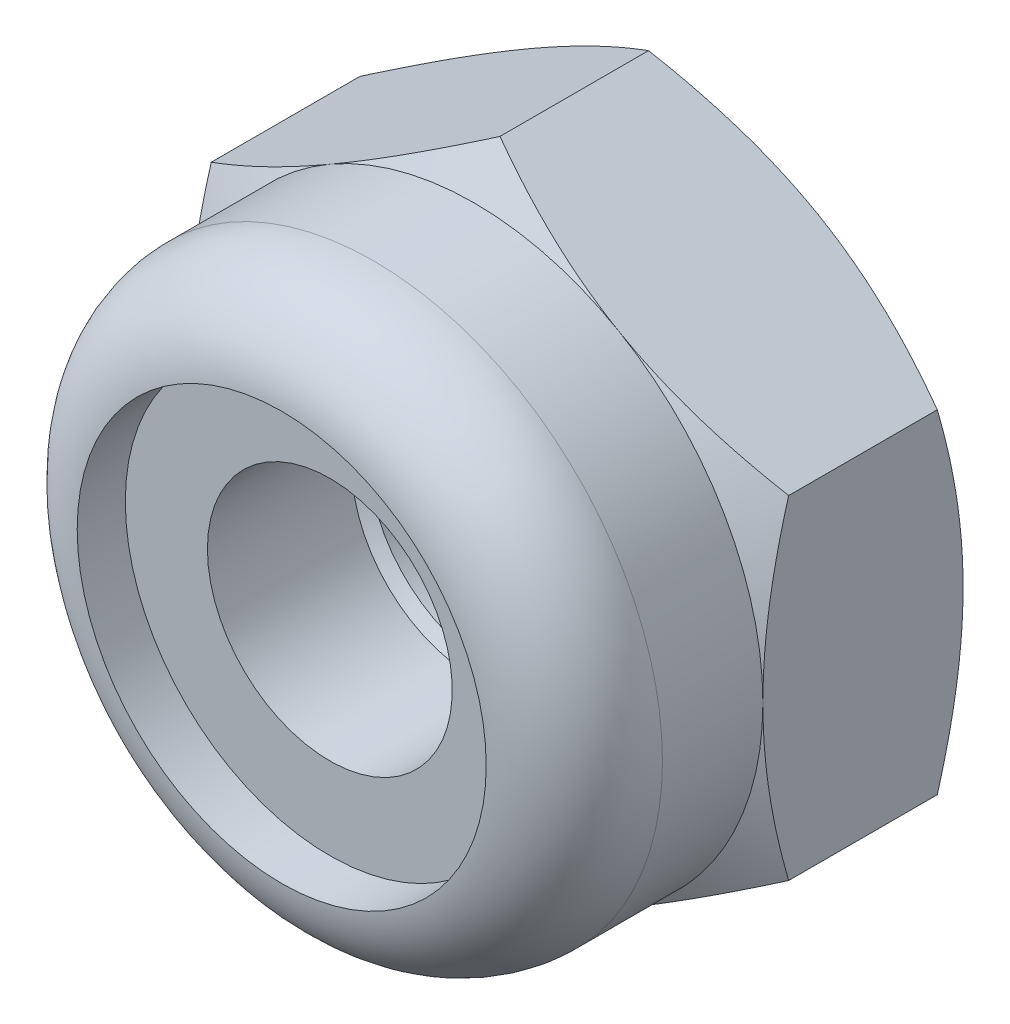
ISO-10303-21;
HEADER;
FILE_DESCRIPTION(('STEP AP214'),'2;1');
FILE_NAME('part.step','',(''),(''),'','','');
FILE_SCHEMA(('AUTOMOTIVE_DESIGN { 1 0 10303 214 1 1 1 1 }'));
ENDSEC;
DATA;
#1=APPLICATION_CONTEXT('core data for automotive mechanical design processes');
#2=APPLICATION_PROTOCOL_DEFINITION('international standard','automotive_design',2000,#1);
#3=PRODUCT_CONTEXT('',#1,'mechanical');
#4=PRODUCT('Part','Part','',(#3));
#5=PRODUCT_RELATED_PRODUCT_CATEGORY('part','',(#4));
#6=PRODUCT_DEFINITION_FORMATION('','',#4);
#7=PRODUCT_DEFINITION_CONTEXT('part definition',#1,'design');
#8=PRODUCT_DEFINITION('design','',#6,#7);
#9=PRODUCT_DEFINITION_SHAPE('','',#8);
#10=(LENGTH_UNIT() NAMED_UNIT(*) SI_UNIT(.MILLI.,.METRE.));
#11=(NAMED_UNIT(*) PLANE_ANGLE_UNIT() SI_UNIT($,.RADIAN.));
#12=(NAMED_UNIT(*) SI_UNIT($,.STERADIAN.) SOLID_ANGLE_UNIT());
#13=UNCERTAINTY_MEASURE_WITH_UNIT(LENGTH_MEASURE(1.E-05),#10,'distance_accuracy_value','');
#14=(GEOMETRIC_REPRESENTATION_CONTEXT(3) GLOBAL_UNCERTAINTY_ASSIGNED_CONTEXT((#13)) GLOBAL_UNIT_ASSIGNED_CONTEXT((#10,
#11,#12)) REPRESENTATION_CONTEXT('',''));
#15=CARTESIAN_POINT('',(0.,0.,0.));
#16=DIRECTION('',(0.,0.,1.));
#17=DIRECTION('',(1.,0.,0.));
#18=AXIS2_PLACEMENT_3D('',#15,#16,#17);
#19=CARTESIAN_POINT('',(0.,0.,-3.302));
#20=DIRECTION('',(0.,0.,0.999999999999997));
#21=DIRECTION('',(1.00000000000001,0.,0.));
#22=AXIS2_PLACEMENT_3D('',#19,#20,#21);
#23=CYLINDRICAL_SURFACE('',#22,2.0193);
#24=CARTESIAN_POINT('',(0.,0.,-0.275671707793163));
#25=DIRECTION('',(0.,0.,0.999999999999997));
#26=DIRECTION('',(1.00000000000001,0.,0.));
#27=AXIS2_PLACEMENT_3D('',#24,#25,#26);
#28=CIRCLE('',#27,2.0193);
#29=CARTESIAN_POINT('',(2.01930000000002,0.,-0.275671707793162));
#30=VERTEX_POINT('',#29);
#31=EDGE_CURVE('E157',#30,#30,#28,.F.);
#32=CARTESIAN_POINT('',(0.,0.,-3.00092829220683));
#33=DIRECTION('',(0.,0.,-0.999999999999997));
#34=DIRECTION('',(-1.00000000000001,0.,0.));
#35=AXIS2_PLACEMENT_3D('',#32,#33,#34);
#36=CIRCLE('',#35,2.0193);
#37=CARTESIAN_POINT('',(2.01930000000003,0.,-3.00092829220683));
#38=VERTEX_POINT('',#37);
#39=EDGE_CURVE('E162',#38,#38,#36,.F.);
#40=CARTESIAN_POINT('',(2.01930000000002,0.,-0.275671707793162));
#41=CARTESIAN_POINT('',(2.01930000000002,0.,-0.304059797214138));
#42=CARTESIAN_POINT('',(2.01930000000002,0.,-0.332447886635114));
#43=CARTESIAN_POINT('',(2.01930000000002,0.,-0.389224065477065));
#44=CARTESIAN_POINT('',(2.01930000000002,0.,-0.417612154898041));
#45=CARTESIAN_POINT('',(2.01930000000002,0.,-0.474388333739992));
#46=CARTESIAN_POINT('',(2.01930000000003,0.,-0.502776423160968));
#47=CARTESIAN_POINT('',(2.01930000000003,0.,-0.559552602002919));
#48=CARTESIAN_POINT('',(2.01930000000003,0.,-0.587940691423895));
#49=CARTESIAN_POINT('',(2.01930000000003,0.,-0.644716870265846));
#50=CARTESIAN_POINT('',(2.01930000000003,0.,-0.673104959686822));
#51=CARTESIAN_POINT('',(2.01930000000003,0.,-0.729881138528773));
#52=CARTESIAN_POINT('',(2.01930000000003,0.,-0.758269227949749));
#53=CARTESIAN_POINT('',(2.01930000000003,0.,-0.8150454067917));
#54=CARTESIAN_POINT('',(2.01930000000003,0.,-0.843433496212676));
#55=CARTESIAN_POINT('',(2.01930000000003,0.,-0.900209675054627));
#56=CARTESIAN_POINT('',(2.01930000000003,0.,-0.928597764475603));
#57=CARTESIAN_POINT('',(2.01930000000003,0.,-0.985373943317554));
#58=CARTESIAN_POINT('',(2.01930000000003,0.,-1.01376203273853));
#59=CARTESIAN_POINT('',(2.01930000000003,0.,-1.07053821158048));
#60=CARTESIAN_POINT('',(2.01930000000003,0.,-1.09892630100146));
#61=CARTESIAN_POINT('',(2.01930000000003,0.,-1.15570247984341));
#62=CARTESIAN_POINT('',(2.01930000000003,0.,-1.18409056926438));
#63=CARTESIAN_POINT('',(2.01930000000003,0.,-1.24086674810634));
#64=CARTESIAN_POINT('',(2.01930000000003,0.,-1.26925483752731));
#65=CARTESIAN_POINT('',(2.01930000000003,0.,-1.32603101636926));
#66=CARTESIAN_POINT('',(2.01930000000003,0.,-1.35441910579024));
#67=CARTESIAN_POINT('',(2.01930000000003,0.,-1.41119528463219));
#68=CARTESIAN_POINT('',(2.01930000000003,0.,-1.43958337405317));
#69=CARTESIAN_POINT('',(2.01930000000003,0.,-1.49635955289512));
#70=CARTESIAN_POINT('',(2.01930000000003,0.,-1.52474764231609));
#71=CARTESIAN_POINT('',(2.01930000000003,0.,-1.58152382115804));
#72=CARTESIAN_POINT('',(2.01930000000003,0.,-1.60991191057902));
#73=CARTESIAN_POINT('',(2.01930000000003,0.,-1.66668808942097));
#74=CARTESIAN_POINT('',(2.01930000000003,0.,-1.69507617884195));
#75=CARTESIAN_POINT('',(2.01930000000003,0.,-1.7518523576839));
#76=CARTESIAN_POINT('',(2.01930000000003,0.,-1.78024044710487));
#77=CARTESIAN_POINT('',(2.01930000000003,0.,-1.83701662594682));
#78=CARTESIAN_POINT('',(2.01930000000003,0.,-1.8654047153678));
#79=CARTESIAN_POINT('',(2.01930000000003,0.,-1.92218089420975));
#80=CARTESIAN_POINT('',(2.01930000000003,0.,-1.95056898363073));
#81=CARTESIAN_POINT('',(2.01930000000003,0.,-2.00734516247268));
#82=CARTESIAN_POINT('',(2.01930000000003,0.,-2.03573325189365));
#83=CARTESIAN_POINT('',(2.01930000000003,0.,-2.09250943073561));
#84=CARTESIAN_POINT('',(2.01930000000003,0.,-2.12089752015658));
#85=CARTESIAN_POINT('',(2.01930000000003,0.,-2.17767369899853));
#86=CARTESIAN_POINT('',(2.01930000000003,0.,-2.20606178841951));
#87=CARTESIAN_POINT('',(2.01930000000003,0.,-2.26283796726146));
#88=CARTESIAN_POINT('',(2.01930000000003,0.,-2.29122605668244));
#89=CARTESIAN_POINT('',(2.01930000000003,0.,-2.34800223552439));
#90=CARTESIAN_POINT('',(2.01930000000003,0.,-2.37639032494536));
#91=CARTESIAN_POINT('',(2.01930000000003,0.,-2.43316650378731));
#92=CARTESIAN_POINT('',(2.01930000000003,0.,-2.46155459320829));
#93=CARTESIAN_POINT('',(2.01930000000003,0.,-2.51833077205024));
#94=CARTESIAN_POINT('',(2.01930000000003,0.,-2.54671886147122));
#95=CARTESIAN_POINT('',(2.01930000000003,0.,-2.60349504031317));
#96=CARTESIAN_POINT('',(2.01930000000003,0.,-2.63188312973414));
#97=CARTESIAN_POINT('',(2.01930000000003,0.,-2.6886593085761));
#98=CARTESIAN_POINT('',(2.01930000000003,0.,-2.71704739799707));
#99=CARTESIAN_POINT('',(2.01930000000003,0.,-2.77382357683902));
#100=CARTESIAN_POINT('',(2.01930000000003,0.,-2.80221166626));
#101=CARTESIAN_POINT('',(2.01930000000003,0.,-2.85898784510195));
#102=CARTESIAN_POINT('',(2.01930000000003,0.,-2.88737593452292));
#103=CARTESIAN_POINT('',(2.01930000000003,0.,-2.94415211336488));
#104=CARTESIAN_POINT('',(2.01930000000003,0.,-2.97254020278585));
#105=CARTESIAN_POINT('',(2.01930000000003,0.,-3.00092829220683));
#106=B_SPLINE_CURVE_WITH_KNOTS('',3,(#40,#41,#42,#43,#44,#45,#46,#47,#48,#49,#50,#51,#52,#53,
#54,#55,#56,#57,#58,#59,#60,#61,#62,#63,#64,#65,#66,#67,#68,#69,#70,#71,#72,#73,#74,#75,#76,#77,
#78,#79,#80,#81,#82,#83,#84,#85,#86,#87,#88,#89,#90,#91,#92,#93,#94,#95,#96,#97,#98,#99,#100,
#101,#102,#103,#104,#105),.UNSPECIFIED.,.F.,.F.,(4,2,2,2,2,2,2,2,2,2,2,2,2,2,2,2,2,2,2,2,2,2,2,
2,2,2,2,2,2,2,2,2,4),(0.,0.0851642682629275,0.170328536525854,0.255492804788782,
0.340657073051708,0.425821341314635,0.510985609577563,0.596149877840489,0.681314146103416,
0.766478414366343,0.85164268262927,0.936806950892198,1.02197121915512,1.10713548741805,
1.19229975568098,1.27746402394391,1.36262829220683,1.44779256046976,1.53295682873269,
1.61812109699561,1.70328536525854,1.78844963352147,1.87361390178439,1.95877817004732,
2.04394243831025,2.12910670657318,2.2142709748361,2.29943524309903,2.38459951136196,
2.46976377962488,2.55492804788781,2.64009231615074,2.72525658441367),.UNSPECIFIED.);
#107=EDGE_CURVE('BSEAM36',#30,#38,#106,.T.);
#108=ORIENTED_EDGE('',*,*,#31,.F.);
#109=ORIENTED_EDGE('',*,*,#39,.F.);
#110=ORIENTED_EDGE('',*,*,#107,.T.);
#111=ORIENTED_EDGE('',*,*,#107,.F.);
#112=EDGE_LOOP('',(#108,#110,#109,#111));
#113=FACE_BOUND('',#112,.T.);
#114=ADVANCED_FACE('F36',(#113),#23,.F.);
#115=CARTESIAN_POINT('',(-9.52500000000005,0.,-3.302));
#116=DIRECTION('',(0.,0.,0.999999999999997));
#117=DIRECTION('',(1.00000000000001,0.,0.));
#118=AXIS2_PLACEMENT_3D('',#115,#116,#117);
#119=PLANE('',#118);
#120=CARTESIAN_POINT('',(0.,0.,-3.302));
#121=DIRECTION('',(0.,0.,0.999999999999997));
#122=DIRECTION('',(1.00000000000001,0.,0.));
#123=AXIS2_PLACEMENT_3D('',#120,#121,#122);
#124=CIRCLE('',#123,4.7625);
#125=CARTESIAN_POINT('',(4.76250000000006,0.,-3.302));
#126=VERTEX_POINT('',#125);
#127=CARTESIAN_POINT('',(2.38125000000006,4.1244459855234,-3.302));
#128=VERTEX_POINT('',#127);
#129=EDGE_CURVE('E218',#126,#128,#124,.T.);
#130=ORIENTED_EDGE('',*,*,#129,.F.);
#131=CARTESIAN_POINT('',(0.,0.,-3.302));
#132=DIRECTION('',(0.,0.,0.999999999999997));
#133=DIRECTION('',(1.00000000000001,0.,0.));
#134=AXIS2_PLACEMENT_3D('',#131,#132,#133);
#135=CIRCLE('',#134,4.7625);
#136=CARTESIAN_POINT('',(2.38125000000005,-4.1244459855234,-3.302));
#137=VERTEX_POINT('',#136);
#138=EDGE_CURVE('E258',#126,#137,#135,.F.);
#139=ORIENTED_EDGE('',*,*,#138,.T.);
#140=CARTESIAN_POINT('',(-2.38124999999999,-4.12444598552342,-3.302));
#141=VERTEX_POINT('',#140);
#142=EDGE_CURVE('E260',#137,#141,#135,.F.);
#143=ORIENTED_EDGE('',*,*,#142,.T.);
#144=CARTESIAN_POINT('',(-4.7625,0.,-3.302));
#145=VERTEX_POINT('',#144);
#146=EDGE_CURVE('E592',#141,#145,#135,.F.);
#147=ORIENTED_EDGE('',*,*,#146,.T.);
#148=CARTESIAN_POINT('',(-2.38125000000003,4.12444598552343,-3.302));
#149=VERTEX_POINT('',#148);
#150=EDGE_CURVE('E590',#145,#149,#135,.F.);
#151=ORIENTED_EDGE('',*,*,#150,.T.);
#152=EDGE_CURVE('E242',#149,#128,#135,.F.);
#153=ORIENTED_EDGE('',*,*,#152,.T.);
#154=EDGE_LOOP('',(#130,#139,#143,#147,#151,#153));
#155=FACE_BOUND('',#154,.T.);
#156=CARTESIAN_POINT('',(0.,0.,-3.302));
#157=DIRECTION('',(0.,0.,0.999999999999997));
#158=DIRECTION('',(1.00000000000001,0.,0.));
#159=AXIS2_PLACEMENT_3D('',#156,#157,#158);
#160=CIRCLE('',#159,2.413);
#161=CARTESIAN_POINT('',(2.41300000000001,0.,-3.302));
#162=VERTEX_POINT('',#161);
#163=EDGE_CURVE('E263',#162,#162,#160,.F.);
#164=ORIENTED_EDGE('',*,*,#163,.F.);
#165=EDGE_LOOP('',(#164));
#166=FACE_BOUND('',#165,.T.);
#167=ADVANCED_FACE('F224',(#155,#166),#119,.F.);
#168=CARTESIAN_POINT('',(0.,5.49926131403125,-3.302));
#169=DIRECTION('',(-0.500000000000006,0.866025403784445,0.));
#170=DIRECTION('',(-0.866025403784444,-0.500000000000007,0.));
#171=AXIS2_PLACEMENT_3D('',#168,#169,#170);
#172=PLANE('',#171);
#173=DIRECTION('',(0.,0.,0.999999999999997));
#174=VECTOR('',#173,1.);
#175=CARTESIAN_POINT('',(-4.76250000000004,2.74963065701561,-3.302));
#176=LINE('',#175,#174);
#177=CARTESIAN_POINT('',(-4.76250000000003,2.74963065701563,-2.87663065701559));
#178=VERTEX_POINT('',#177);
#179=CARTESIAN_POINT('',(-4.76250000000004,2.74963065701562,-0.4253693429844));
#180=VERTEX_POINT('',#179);
#181=EDGE_CURVE('E254',#178,#180,#176,.T.);
#182=ORIENTED_EDGE('',*,*,#181,.T.);
#183=CARTESIAN_POINT('',(-4.76270000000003,2.74951518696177,-0.425436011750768));
#184=CARTESIAN_POINT('',(-4.55340263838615,2.87035307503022,-0.35565361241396));
#185=CARTESIAN_POINT('',(-4.3423151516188,2.99222449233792,-0.292183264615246));
#186=CARTESIAN_POINT('',(-3.91648500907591,3.23807763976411,-0.181395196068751));
#187=CARTESIAN_POINT('',(-3.70173478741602,3.36206373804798,-0.134116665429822));
#188=CARTESIAN_POINT('',(-3.27486304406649,3.60851825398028,-0.0605335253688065));
#189=CARTESIAN_POINT('',(-3.06280800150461,3.7309482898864,-0.033738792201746));
#190=CARTESIAN_POINT('',(-2.74397949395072,3.91502401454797,-0.00971112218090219));
#191=CARTESIAN_POINT('',(-2.63763059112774,3.97642458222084,-0.00439464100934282));
#192=CARTESIAN_POINT('',(-2.42483449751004,4.09928246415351,0.000759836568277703));
#193=CARTESIAN_POINT('',(-2.31838730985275,4.16073977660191,0.000598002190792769));
#194=CARTESIAN_POINT('',(-2.02675051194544,4.32911636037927,-0.00738494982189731));
#195=CARTESIAN_POINT('',(-1.84165753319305,4.43597984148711,-0.0207924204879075));
#196=CARTESIAN_POINT('',(-1.47270002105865,4.64899756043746,-0.063307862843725));
#197=CARTESIAN_POINT('',(-1.28883678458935,4.75515104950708,-0.0924303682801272));
#198=CARTESIAN_POINT('',(-0.919135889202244,4.96859796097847,-0.165229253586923));
#199=CARTESIAN_POINT('',(-0.733344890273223,5.07586444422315,-0.209214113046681));
#200=CARTESIAN_POINT('',(-0.364533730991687,5.28879766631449,-0.309042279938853));
#201=CARTESIAN_POINT('',(-0.181508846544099,5.39446713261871,-0.364862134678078));
#202=CARTESIAN_POINT('',(0.000199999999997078,5.49937678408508,-0.425436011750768));
#203=B_SPLINE_CURVE_WITH_KNOTS('',3,(#183,#184,#185,#186,#187,#188,#189,#190,#191,#192,#193,
#194,#195,#196,#197,#198,#199,#200,#201,#202),.UNSPECIFIED.,.F.,.F.,(4,2,2,2,2,2,2,2,2,4),(0.,
0.754910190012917,1.51163483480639,2.24963134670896,2.6182733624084,2.98690399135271,
3.62867423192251,4.27103902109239,4.92765153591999,5.58297484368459),.UNSPECIFIED.);
#204=CARTESIAN_POINT('',(-2.38125000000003,4.12444598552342,0.));
#205=VERTEX_POINT('',#204);
#206=EDGE_CURVE('E60',#180,#205,#203,.T.);
#207=ORIENTED_EDGE('',*,*,#206,.T.);
#208=CARTESIAN_POINT('',(0.,5.49926131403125,-0.425369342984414));
#209=VERTEX_POINT('',#208);
#210=EDGE_CURVE('E139',#205,#209,#203,.T.);
#211=ORIENTED_EDGE('',*,*,#210,.T.);
#212=DIRECTION('',(0.,0.,0.999999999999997));
#213=VECTOR('',#212,1.);
#214=CARTESIAN_POINT('',(0.,5.49926131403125,-3.302));
#215=LINE('',#214,#213);
#216=CARTESIAN_POINT('',(0.,5.49926131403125,-2.87663065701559));
#217=VERTEX_POINT('',#216);
#218=EDGE_CURVE('E136',#217,#209,#215,.T.);
#219=ORIENTED_EDGE('',*,*,#218,.F.);
#220=CARTESIAN_POINT('',(-4.76270000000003,2.74951518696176,-2.87656398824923));
#221=CARTESIAN_POINT('',(-4.55340263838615,2.87035307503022,-2.94634638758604));
#222=CARTESIAN_POINT('',(-4.3423151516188,2.99222449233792,-3.00981673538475));
#223=CARTESIAN_POINT('',(-3.91648500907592,3.23807763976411,-3.12060480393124));
#224=CARTESIAN_POINT('',(-3.70173478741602,3.36206373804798,-3.16788333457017));
#225=CARTESIAN_POINT('',(-3.2748630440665,3.60851825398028,-3.24146647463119));
#226=CARTESIAN_POINT('',(-3.06280800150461,3.7309482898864,-3.26826120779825));
#227=CARTESIAN_POINT('',(-2.74397949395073,3.91502401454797,-3.29228887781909));
#228=CARTESIAN_POINT('',(-2.63763059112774,3.97642458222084,-3.29760535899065));
#229=CARTESIAN_POINT('',(-2.42483449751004,4.09928246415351,-3.30275983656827));
#230=CARTESIAN_POINT('',(-2.31838730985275,4.16073977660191,-3.30259800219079));
#231=CARTESIAN_POINT('',(-2.02675051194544,4.32911636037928,-3.2946150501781));
#232=CARTESIAN_POINT('',(-1.84165753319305,4.43597984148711,-3.28120757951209));
#233=CARTESIAN_POINT('',(-1.47270002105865,4.64899756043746,-3.23869213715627));
#234=CARTESIAN_POINT('',(-1.28883678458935,4.75515104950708,-3.20956963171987));
#235=CARTESIAN_POINT('',(-0.919135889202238,4.96859796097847,-3.13677074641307));
#236=CARTESIAN_POINT('',(-0.733344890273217,5.07586444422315,-3.09278588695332));
#237=CARTESIAN_POINT('',(-0.364533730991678,5.28879766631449,-2.99295772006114));
#238=CARTESIAN_POINT('',(-0.181508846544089,5.39446713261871,-2.93713786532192));
#239=CARTESIAN_POINT('',(0.000200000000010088,5.49937678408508,-2.87656398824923));
#240=B_SPLINE_CURVE_WITH_KNOTS('',3,(#220,#221,#222,#223,#224,#225,#226,#227,#228,#229,#230,
#231,#232,#233,#234,#235,#236,#237,#238,#239),.UNSPECIFIED.,.F.,.F.,(4,2,2,2,2,2,2,2,2,4),(0.,
0.754910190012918,1.51163483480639,2.24963134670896,2.61827336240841,2.98690399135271,
3.62867423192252,4.2710390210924,4.92765153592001,5.5829748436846),.UNSPECIFIED.);
#241=EDGE_CURVE('E257',#149,#217,#240,.T.);
#242=ORIENTED_EDGE('',*,*,#241,.F.);
#243=EDGE_CURVE('E236',#178,#149,#240,.T.);
#244=ORIENTED_EDGE('',*,*,#243,.F.);
#245=EDGE_LOOP('',(#182,#207,#211,#219,#242,#244));
#246=FACE_BOUND('',#245,.T.);
#247=ADVANCED_FACE('F38',(#246),#172,.T.);
#248=CARTESIAN_POINT('',(4.76250000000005,2.74963065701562,-3.302));
#249=DIRECTION('',(0.500000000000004,0.866025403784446,0.));
#250=DIRECTION('',(-0.866025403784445,0.500000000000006,0.));
#251=AXIS2_PLACEMENT_3D('',#248,#249,#250);
#252=PLANE('',#251);
#253=ORIENTED_EDGE('',*,*,#218,.T.);
#254=CARTESIAN_POINT('',(-0.000200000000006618,5.49937678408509,-0.425436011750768));
#255=CARTESIAN_POINT('',(0.209097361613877,5.37853889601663,-0.355653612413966));
#256=CARTESIAN_POINT('',(0.420184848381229,5.25666747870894,-0.292183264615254));
#257=CARTESIAN_POINT('',(0.846014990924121,5.01081433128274,-0.18139519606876));
#258=CARTESIAN_POINT('',(1.06076521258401,4.88682823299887,-0.134116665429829));
#259=CARTESIAN_POINT('',(1.48763695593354,4.64037371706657,-0.0605335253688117));
#260=CARTESIAN_POINT('',(1.69969199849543,4.51794368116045,-0.0337387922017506));
#261=CARTESIAN_POINT('',(2.01852050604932,4.33386795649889,-0.00971112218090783));
#262=CARTESIAN_POINT('',(2.12486940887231,4.27246738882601,-0.00439464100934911));
#263=CARTESIAN_POINT('',(2.33766550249,4.14960950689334,0.000759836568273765));
#264=CARTESIAN_POINT('',(2.44411269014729,4.08815219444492,0.00059800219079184));
#265=CARTESIAN_POINT('',(2.73574948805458,3.91977561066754,-0.00738494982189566));
#266=CARTESIAN_POINT('',(2.92084246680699,3.81291212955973,-0.0207924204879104));
#267=CARTESIAN_POINT('',(3.2897999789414,3.5998944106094,-0.0633078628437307));
#268=CARTESIAN_POINT('',(3.4736632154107,3.49374092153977,-0.0924303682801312));
#269=CARTESIAN_POINT('',(3.8433641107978,3.28029401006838,-0.165229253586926));
#270=CARTESIAN_POINT('',(4.02915510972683,3.1730275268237,-0.209214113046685));
#271=CARTESIAN_POINT('',(4.39796626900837,2.96009430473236,-0.309042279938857));
#272=CARTESIAN_POINT('',(4.58099115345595,2.85442483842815,-0.364862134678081));
#273=CARTESIAN_POINT('',(4.76270000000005,2.74951518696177,-0.425436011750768));
#274=B_SPLINE_CURVE_WITH_KNOTS('',3,(#254,#255,#256,#257,#258,#259,#260,#261,#262,#263,#264,
#265,#266,#267,#268,#269,#270,#271,#272,#273),.UNSPECIFIED.,.F.,.F.,(4,2,2,2,2,2,2,2,2,4),(0.,
0.754910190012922,1.5116348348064,2.24963134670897,2.61827336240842,2.98690399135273,
3.62867423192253,4.27103902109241,4.92765153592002,5.58297484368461),.UNSPECIFIED.);
#275=CARTESIAN_POINT('',(2.38125000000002,4.1244459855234,0.));
#276=VERTEX_POINT('',#275);
#277=EDGE_CURVE('E128',#209,#276,#274,.T.);
#278=ORIENTED_EDGE('',*,*,#277,.T.);
#279=CARTESIAN_POINT('',(4.76250000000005,2.74963065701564,-0.425369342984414));
#280=VERTEX_POINT('',#279);
#281=EDGE_CURVE('E132',#276,#280,#274,.T.);
#282=ORIENTED_EDGE('',*,*,#281,.T.);
#283=DIRECTION('',(0.,0.,0.999999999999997));
#284=VECTOR('',#283,1.);
#285=CARTESIAN_POINT('',(4.76250000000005,2.74963065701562,-3.302));
#286=LINE('',#285,#284);
#287=CARTESIAN_POINT('',(4.76250000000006,2.74963065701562,-2.87663065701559));
#288=VERTEX_POINT('',#287);
#289=EDGE_CURVE('E243',#288,#280,#286,.T.);
#290=ORIENTED_EDGE('',*,*,#289,.F.);
#291=CARTESIAN_POINT('',(-0.000199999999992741,5.49937678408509,-2.87656398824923));
#292=CARTESIAN_POINT('',(0.209097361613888,5.37853889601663,-2.94634638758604));
#293=CARTESIAN_POINT('',(0.42018484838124,5.25666747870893,-3.00981673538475));
#294=CARTESIAN_POINT('',(0.846014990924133,5.01081433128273,-3.12060480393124));
#295=CARTESIAN_POINT('',(1.06076521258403,4.88682823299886,-3.16788333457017));
#296=CARTESIAN_POINT('',(1.48763695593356,4.64037371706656,-3.24146647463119));
#297=CARTESIAN_POINT('',(1.69969199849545,4.51794368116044,-3.26826120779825));
#298=CARTESIAN_POINT('',(2.01852050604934,4.33386795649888,-3.2922888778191));
#299=CARTESIAN_POINT('',(2.12486940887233,4.272467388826,-3.29760535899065));
#300=CARTESIAN_POINT('',(2.33766550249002,4.14960950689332,-3.30275983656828));
#301=CARTESIAN_POINT('',(2.44411269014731,4.08815219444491,-3.30259800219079));
#302=CARTESIAN_POINT('',(2.7357494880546,3.91977561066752,-3.2946150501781));
#303=CARTESIAN_POINT('',(2.92084246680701,3.81291212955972,-3.28120757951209));
#304=CARTESIAN_POINT('',(3.28979997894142,3.59989441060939,-3.23869213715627));
#305=CARTESIAN_POINT('',(3.47366321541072,3.49374092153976,-3.20956963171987));
#306=CARTESIAN_POINT('',(3.84336411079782,3.28029401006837,-3.13677074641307));
#307=CARTESIAN_POINT('',(4.02915510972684,3.17302752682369,-3.09278588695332));
#308=CARTESIAN_POINT('',(4.39796626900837,2.96009430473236,-2.99295772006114));
#309=CARTESIAN_POINT('',(4.58099115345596,2.85442483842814,-2.93713786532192));
#310=CARTESIAN_POINT('',(4.76270000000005,2.74951518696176,-2.87656398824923));
#311=B_SPLINE_CURVE_WITH_KNOTS('',3,(#291,#292,#293,#294,#295,#296,#297,#298,#299,#300,#301,
#302,#303,#304,#305,#306,#307,#308,#309,#310),.UNSPECIFIED.,.F.,.F.,(4,2,2,2,2,2,2,2,2,4),(0.,
0.754910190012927,1.5116348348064,2.24963134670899,2.61827336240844,2.98690399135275,
3.62867423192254,4.27103902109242,4.92765153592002,5.58297484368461),.UNSPECIFIED.);
#312=EDGE_CURVE('E228',#128,#288,#311,.T.);
#313=ORIENTED_EDGE('',*,*,#312,.F.);
#314=EDGE_CURVE('E234',#217,#128,#311,.T.);
#315=ORIENTED_EDGE('',*,*,#314,.F.);
#316=EDGE_LOOP('',(#253,#278,#282,#290,#313,#315));
#317=FACE_BOUND('',#316,.T.);
#318=ADVANCED_FACE('F130',(#317),#252,.T.);
#319=CARTESIAN_POINT('',(4.76250000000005,2.74963065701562,-3.302));
#320=DIRECTION('',(-1.00000000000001,0.,0.));
#321=DIRECTION('',(0.,0.,0.999999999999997));
#322=AXIS2_PLACEMENT_3D('',#319,#320,#321);
#323=PLANE('',#322);
#324=CARTESIAN_POINT('',(4.76250000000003,-7.2924257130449,-2.27898343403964));
#325=CARTESIAN_POINT('',(4.76250000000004,-7.08332503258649,-2.17793443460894));
#326=CARTESIAN_POINT('',(4.76250000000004,-6.87372996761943,-2.07788994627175));
#327=CARTESIAN_POINT('',(4.76250000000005,-6.45328375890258,-1.88038400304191));
#328=CARTESIAN_POINT('',(4.76250000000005,-6.24243240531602,-1.78292299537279));
#329=CARTESIAN_POINT('',(4.76250000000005,-5.81806730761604,-1.59064459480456));
#330=CARTESIAN_POINT('',(4.76250000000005,-5.60454523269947,-1.49584552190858));
#331=CARTESIAN_POINT('',(4.76250000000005,-5.17574610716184,-1.31031922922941));
#332=CARTESIAN_POINT('',(4.76250000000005,-4.96046914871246,-1.21959179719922));
#333=CARTESIAN_POINT('',(4.76250000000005,-4.52514542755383,-1.04221436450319));
#334=CARTESIAN_POINT('',(4.76250000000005,-4.30507255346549,-0.955628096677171));
#335=CARTESIAN_POINT('',(4.76250000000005,-3.86233085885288,-0.789237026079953));
#336=CARTESIAN_POINT('',(4.76250000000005,-3.63966175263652,-0.70943297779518));
#337=CARTESIAN_POINT('',(4.76250000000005,-3.19183146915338,-0.558750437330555));
#338=CARTESIAN_POINT('',(4.76250000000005,-2.96667674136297,-0.487852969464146));
#339=CARTESIAN_POINT('',(4.76250000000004,-2.51316408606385,-0.357286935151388));
#340=CARTESIAN_POINT('',(4.76250000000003,-2.28480719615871,-0.297614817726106));
#341=CARTESIAN_POINT('',(4.76250000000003,-1.82474524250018,-0.192393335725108));
#342=CARTESIAN_POINT('',(4.76250000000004,-1.59303930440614,-0.146847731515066));
#343=CARTESIAN_POINT('',(4.76250000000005,-1.12680140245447,-0.072957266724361));
#344=CARTESIAN_POINT('',(4.76250000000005,-0.892269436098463,-0.0446124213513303));
#345=CARTESIAN_POINT('',(4.76250000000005,-0.540098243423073,-0.0168127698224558));
#346=CARTESIAN_POINT('',(4.76250000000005,-0.423010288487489,-0.00999774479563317));
#347=CARTESIAN_POINT('',(4.76250000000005,-0.188645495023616,-0.00132916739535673));
#348=CARTESIAN_POINT('',(4.76250000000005,-0.0713686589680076,0.000524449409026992));
#349=CARTESIAN_POINT('',(4.76250000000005,0.163123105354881,-0.000779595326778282));
#350=CARTESIAN_POINT('',(4.76250000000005,0.280338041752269,-0.00393584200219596));
#351=CARTESIAN_POINT('',(4.76250000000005,0.514533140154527,-0.0151795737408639));
#352=CARTESIAN_POINT('',(4.76250000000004,0.63151328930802,-0.0232673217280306));
#353=CARTESIAN_POINT('',(4.76250000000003,0.915050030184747,-0.0486788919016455));
#354=CARTESIAN_POINT('',(4.76250000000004,1.08138937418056,-0.0684745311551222));
#355=CARTESIAN_POINT('',(4.76250000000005,1.41276151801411,-0.116933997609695));
#356=CARTESIAN_POINT('',(4.76250000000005,1.57779414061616,-0.145599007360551));
#357=CARTESIAN_POINT('',(4.76250000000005,2.07083902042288,-0.243383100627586));
#358=CARTESIAN_POINT('',(4.76250000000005,2.39654516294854,-0.32426565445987));
#359=CARTESIAN_POINT('',(4.76250000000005,2.88391142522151,-0.463767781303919));
#360=CARTESIAN_POINT('',(4.76250000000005,3.04811363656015,-0.514009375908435));
#361=CARTESIAN_POINT('',(4.76250000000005,3.37480455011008,-0.61946386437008));
#362=CARTESIAN_POINT('',(4.76250000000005,3.53729434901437,-0.674673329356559));
#363=CARTESIAN_POINT('',(4.76250000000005,3.85988055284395,-0.788914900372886));
#364=CARTESIAN_POINT('',(4.76250000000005,4.0199852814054,-0.847923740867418));
#365=CARTESIAN_POINT('',(4.76250000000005,4.33895253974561,-0.969404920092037));
#366=CARTESIAN_POINT('',(4.76250000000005,4.49781453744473,-1.03187865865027));
#367=CARTESIAN_POINT('',(4.76250000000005,4.65610216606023,-1.09574291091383));
#368=B_SPLINE_CURVE_WITH_KNOTS('',3,(#324,#325,#326,#327,#328,#329,#330,#331,#332,#333,#334,
#335,#336,#337,#338,#339,#340,#341,#342,#343,#344,#345,#346,#347,#348,#349,#350,#351,#352,#353,
#354,#355,#356,#357,#358,#359,#360,#361,#362,#363,#364,#365,#366,#367),.UNSPECIFIED.,.F.,.F.,(4,
2,2,2,2,2,2,2,2,2,2,2,2,2,2,2,2,2,2,2,2,4),(0.,0.696720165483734,1.39356016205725,
2.09438789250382,2.79517904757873,3.50457374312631,4.21404725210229,4.92198260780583,
5.62969364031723,6.33759289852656,7.0454927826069,7.39726182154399,7.7490262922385,
8.10069143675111,8.45237533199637,8.95462912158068,9.45694990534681,10.4623513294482,
10.9774608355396,11.4922174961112,12.0040767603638,12.5161443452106),.UNSPECIFIED.);
#369=CARTESIAN_POINT('',(4.76250000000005,-2.74963065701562,-0.425369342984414));
#370=VERTEX_POINT('',#369);
#371=CARTESIAN_POINT('',(4.76250000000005,0.,0.));
#372=VERTEX_POINT('',#371);
#373=EDGE_CURVE('E204',#370,#372,#368,.T.);
#374=ORIENTED_EDGE('',*,*,#373,.F.);
#375=DIRECTION('',(0.,0.,0.999999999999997));
#376=VECTOR('',#375,1.);
#377=CARTESIAN_POINT('',(4.76250000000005,-2.74963065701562,-3.302));
#378=LINE('',#377,#376);
#379=CARTESIAN_POINT('',(4.76250000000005,-2.74963065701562,-2.87663065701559));
#380=VERTEX_POINT('',#379);
#381=EDGE_CURVE('E245',#380,#370,#378,.T.);
#382=ORIENTED_EDGE('',*,*,#381,.F.);
#383=CARTESIAN_POINT('',(4.76250000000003,-7.2924257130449,-1.02301656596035));
#384=CARTESIAN_POINT('',(4.76250000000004,-7.08332503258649,-1.12406556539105));
#385=CARTESIAN_POINT('',(4.76250000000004,-6.87372996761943,-1.22411005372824));
#386=CARTESIAN_POINT('',(4.76250000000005,-6.45328375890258,-1.42161599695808));
#387=CARTESIAN_POINT('',(4.76250000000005,-6.24243240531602,-1.51907700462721));
#388=CARTESIAN_POINT('',(4.76250000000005,-5.81806730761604,-1.71135540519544));
#389=CARTESIAN_POINT('',(4.76250000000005,-5.60454523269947,-1.80615447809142));
#390=CARTESIAN_POINT('',(4.76250000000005,-5.17574610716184,-1.99168077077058));
#391=CARTESIAN_POINT('',(4.76250000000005,-4.96046914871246,-2.08240820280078));
#392=CARTESIAN_POINT('',(4.76250000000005,-4.52514542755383,-2.25978563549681));
#393=CARTESIAN_POINT('',(4.76250000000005,-4.3050725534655,-2.34637190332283));
#394=CARTESIAN_POINT('',(4.76250000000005,-3.86233085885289,-2.51276297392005));
#395=CARTESIAN_POINT('',(4.76250000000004,-3.63966175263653,-2.59256702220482));
#396=CARTESIAN_POINT('',(4.76250000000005,-3.19183146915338,-2.74324956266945));
#397=CARTESIAN_POINT('',(4.76250000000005,-2.96667674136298,-2.81414703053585));
#398=CARTESIAN_POINT('',(4.76250000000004,-2.51316408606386,-2.94471306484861));
#399=CARTESIAN_POINT('',(4.76250000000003,-2.28480719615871,-3.00438518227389));
#400=CARTESIAN_POINT('',(4.76250000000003,-1.82474524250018,-3.10960666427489));
#401=CARTESIAN_POINT('',(4.76250000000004,-1.59303930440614,-3.15515226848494));
#402=CARTESIAN_POINT('',(4.76250000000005,-1.12680140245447,-3.22904273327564));
#403=CARTESIAN_POINT('',(4.76250000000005,-0.892269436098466,-3.25738757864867));
#404=CARTESIAN_POINT('',(4.76250000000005,-0.540098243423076,-3.28518723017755));
#405=CARTESIAN_POINT('',(4.76250000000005,-0.423010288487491,-3.29200225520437));
#406=CARTESIAN_POINT('',(4.76250000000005,-0.188645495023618,-3.30067083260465));
#407=CARTESIAN_POINT('',(4.76250000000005,-0.0713686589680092,-3.30252444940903));
#408=CARTESIAN_POINT('',(4.76250000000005,0.163123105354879,-3.30122040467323));
#409=CARTESIAN_POINT('',(4.76250000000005,0.280338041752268,-3.29806415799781));
#410=CARTESIAN_POINT('',(4.76250000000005,0.514533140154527,-3.28682042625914));
#411=CARTESIAN_POINT('',(4.76250000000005,0.63151328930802,-3.27873267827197));
#412=CARTESIAN_POINT('',(4.76250000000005,0.915050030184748,-3.25332110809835));
#413=CARTESIAN_POINT('',(4.76250000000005,1.08138937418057,-3.23352546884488));
#414=CARTESIAN_POINT('',(4.76250000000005,1.41276151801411,-3.18506600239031));
#415=CARTESIAN_POINT('',(4.76250000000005,1.57779414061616,-3.15640099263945));
#416=CARTESIAN_POINT('',(4.76250000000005,2.07083902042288,-3.05861689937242));
#417=CARTESIAN_POINT('',(4.76250000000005,2.39654516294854,-2.97773434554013));
#418=CARTESIAN_POINT('',(4.76250000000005,2.88391142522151,-2.83823221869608));
#419=CARTESIAN_POINT('',(4.76250000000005,3.04811363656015,-2.78799062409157));
#420=CARTESIAN_POINT('',(4.76250000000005,3.37480455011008,-2.68253613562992));
#421=CARTESIAN_POINT('',(4.76250000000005,3.53729434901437,-2.62732667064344));
#422=CARTESIAN_POINT('',(4.76250000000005,3.85988055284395,-2.51308509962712));
#423=CARTESIAN_POINT('',(4.76250000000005,4.01998528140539,-2.45407625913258));
#424=CARTESIAN_POINT('',(4.76250000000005,4.33895253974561,-2.33259507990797));
#425=CARTESIAN_POINT('',(4.76250000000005,4.49781453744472,-2.27012134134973));
#426=CARTESIAN_POINT('',(4.76250000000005,4.65610216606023,-2.20625708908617));
#427=B_SPLINE_CURVE_WITH_KNOTS('',3,(#383,#384,#385,#386,#387,#388,#389,#390,#391,#392,#393,
#394,#395,#396,#397,#398,#399,#400,#401,#402,#403,#404,#405,#406,#407,#408,#409,#410,#411,#412,
#413,#414,#415,#416,#417,#418,#419,#420,#421,#422,#423,#424,#425,#426),.UNSPECIFIED.,.F.,.F.,(4,
2,2,2,2,2,2,2,2,2,2,2,2,2,2,2,2,2,2,2,2,4),(0.,0.696720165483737,1.39356016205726,
2.09438789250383,2.79517904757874,3.50457374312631,4.21404725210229,4.92198260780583,
5.62969364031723,6.33759289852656,7.0454927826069,7.39726182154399,7.74902629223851,
8.10069143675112,8.45237533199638,8.95462912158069,9.45694990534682,10.4623513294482,
10.9774608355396,11.4922174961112,12.0040767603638,12.5161443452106),.UNSPECIFIED.);
#428=EDGE_CURVE('E572',#380,#126,#427,.T.);
#429=ORIENTED_EDGE('',*,*,#428,.T.);
#430=EDGE_CURVE('E235',#126,#288,#427,.T.);
#431=ORIENTED_EDGE('',*,*,#430,.T.);
#432=ORIENTED_EDGE('',*,*,#289,.T.);
#433=EDGE_CURVE('E151',#372,#280,#368,.T.);
#434=ORIENTED_EDGE('',*,*,#433,.F.);
#435=EDGE_LOOP('',(#374,#382,#429,#431,#432,#434));
#436=FACE_BOUND('',#435,.T.);
#437=ADVANCED_FACE('F223',(#436),#323,.F.);
#438=CARTESIAN_POINT('',(0.,-5.49926131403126,-3.302));
#439=DIRECTION('',(0.500000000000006,-0.866025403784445,0.));
#440=DIRECTION('',(0.866025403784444,0.500000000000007,0.));
#441=AXIS2_PLACEMENT_3D('',#438,#439,#440);
#442=PLANE('',#441);
#443=ORIENTED_EDGE('',*,*,#381,.T.);
#444=CARTESIAN_POINT('',(4.76270000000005,-2.74951518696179,-0.425436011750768));
#445=CARTESIAN_POINT('',(4.55340263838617,-2.87035307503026,-0.355653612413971));
#446=CARTESIAN_POINT('',(4.34231515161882,-2.99222449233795,-0.292183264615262));
#447=CARTESIAN_POINT('',(3.91648500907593,-3.23807763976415,-0.181395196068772));
#448=CARTESIAN_POINT('',(3.70173478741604,-3.36206373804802,-0.134116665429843));
#449=CARTESIAN_POINT('',(3.27486304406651,-3.60851825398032,-0.0605335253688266));
#450=CARTESIAN_POINT('',(3.06280800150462,-3.73094828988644,-0.033738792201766));
#451=CARTESIAN_POINT('',(2.74397949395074,-3.91502401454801,-0.00971112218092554));
#452=CARTESIAN_POINT('',(2.63763059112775,-3.97642458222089,-0.0043946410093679));
#453=CARTESIAN_POINT('',(2.42483449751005,-4.09928246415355,0.000759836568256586));
#454=CARTESIAN_POINT('',(2.31838730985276,-4.16073977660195,0.000598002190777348));
#455=CARTESIAN_POINT('',(2.02675051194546,-4.32911636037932,-0.00738494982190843));
#456=CARTESIAN_POINT('',(1.84165753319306,-4.43597984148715,-0.0207924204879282));
#457=CARTESIAN_POINT('',(1.47270002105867,-4.6489975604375,-0.0633078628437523));
#458=CARTESIAN_POINT('',(1.28883678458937,-4.75515104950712,-0.0924303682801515));
#459=CARTESIAN_POINT('',(0.919135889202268,-4.9685979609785,-0.165229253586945));
#460=CARTESIAN_POINT('',(0.733344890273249,-5.07586444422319,-0.209214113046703));
#461=CARTESIAN_POINT('',(0.364533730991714,-5.28879766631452,-0.309042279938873));
#462=CARTESIAN_POINT('',(0.181508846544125,-5.39446713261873,-0.364862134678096));
#463=CARTESIAN_POINT('',(-0.000199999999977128,-5.49937678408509,-0.425436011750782));
#464=B_SPLINE_CURVE_WITH_KNOTS('',3,(#444,#445,#446,#447,#448,#449,#450,#451,#452,#453,#454,
#455,#456,#457,#458,#459,#460,#461,#462,#463),.UNSPECIFIED.,.F.,.F.,(4,2,2,2,2,2,2,2,2,4),(0.,
0.75491019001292,1.51163483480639,2.24963134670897,2.61827336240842,2.98690399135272,
3.62867423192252,4.27103902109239,4.92765153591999,5.58297484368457),.UNSPECIFIED.);
#465=CARTESIAN_POINT('',(2.38125000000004,-4.12444598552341,0.));
#466=VERTEX_POINT('',#465);
#467=EDGE_CURVE('E619',#370,#466,#464,.T.);
#468=ORIENTED_EDGE('',*,*,#467,.T.);
#469=CARTESIAN_POINT('',(0.,-5.49926131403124,-0.425369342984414));
#470=VERTEX_POINT('',#469);
#471=EDGE_CURVE('E198',#466,#470,#464,.T.);
#472=ORIENTED_EDGE('',*,*,#471,.T.);
#473=DIRECTION('',(0.,0.,0.999999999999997));
#474=VECTOR('',#473,1.);
#475=CARTESIAN_POINT('',(0.,-5.49926131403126,-3.302));
#476=LINE('',#475,#474);
#477=CARTESIAN_POINT('',(0.,-5.49926131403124,-2.87663065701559));
#478=VERTEX_POINT('',#477);
#479=EDGE_CURVE('E248',#478,#470,#476,.T.);
#480=ORIENTED_EDGE('',*,*,#479,.F.);
#481=CARTESIAN_POINT('',(4.76270000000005,-2.74951518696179,-2.87656398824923));
#482=CARTESIAN_POINT('',(4.55340263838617,-2.87035307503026,-2.94634638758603));
#483=CARTESIAN_POINT('',(4.34231515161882,-2.99222449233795,-3.00981673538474));
#484=CARTESIAN_POINT('',(3.91648500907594,-3.23807763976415,-3.12060480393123));
#485=CARTESIAN_POINT('',(3.70173478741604,-3.36206373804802,-3.16788333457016));
#486=CARTESIAN_POINT('',(3.27486304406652,-3.60851825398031,-3.24146647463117));
#487=CARTESIAN_POINT('',(3.06280800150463,-3.73094828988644,-3.26826120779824));
#488=CARTESIAN_POINT('',(2.74397949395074,-3.915024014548,-3.29228887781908));
#489=CARTESIAN_POINT('',(2.63763059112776,-3.97642458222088,-3.29760535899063));
#490=CARTESIAN_POINT('',(2.42483449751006,-4.09928246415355,-3.30275983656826));
#491=CARTESIAN_POINT('',(2.31838730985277,-4.16073977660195,-3.30259800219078));
#492=CARTESIAN_POINT('',(2.02675051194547,-4.32911636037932,-3.29461505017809));
#493=CARTESIAN_POINT('',(1.84165753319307,-4.43597984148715,-3.28120757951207));
#494=CARTESIAN_POINT('',(1.47270002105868,-4.64899756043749,-3.23869213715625));
#495=CARTESIAN_POINT('',(1.28883678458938,-4.75515104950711,-3.20956963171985));
#496=CARTESIAN_POINT('',(0.919135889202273,-4.9685979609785,-3.13677074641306));
#497=CARTESIAN_POINT('',(0.733344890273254,-5.07586444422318,-3.0927858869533));
#498=CARTESIAN_POINT('',(0.364533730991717,-5.28879766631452,-2.99295772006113));
#499=CARTESIAN_POINT('',(0.181508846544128,-5.39446713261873,-2.9371378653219));
#500=CARTESIAN_POINT('',(-0.000199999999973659,-5.49937678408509,-2.87656398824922));
#501=B_SPLINE_CURVE_WITH_KNOTS('',3,(#481,#482,#483,#484,#485,#486,#487,#488,#489,#490,#491,
#492,#493,#494,#495,#496,#497,#498,#499,#500),.UNSPECIFIED.,.F.,.F.,(4,2,2,2,2,2,2,2,2,4),(0.,
0.754910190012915,1.51163483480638,2.24963134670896,2.6182733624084,2.98690399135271,
3.62867423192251,4.27103902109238,4.92765153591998,5.58297484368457),.UNSPECIFIED.);
#502=EDGE_CURVE('E561',#137,#478,#501,.T.);
#503=ORIENTED_EDGE('',*,*,#502,.F.);
#504=EDGE_CURVE('E566',#380,#137,#501,.T.);
#505=ORIENTED_EDGE('',*,*,#504,.F.);
#506=EDGE_LOOP('',(#443,#468,#472,#480,#503,#505));
#507=FACE_BOUND('',#506,.T.);
#508=ADVANCED_FACE('F361',(#507),#442,.T.);
#509=CARTESIAN_POINT('',(-4.76250000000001,-2.74963065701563,-3.302));
#510=DIRECTION('',(-0.500000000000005,-0.866025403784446,0.));
#511=DIRECTION('',(0.866025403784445,-0.500000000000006,0.));
#512=AXIS2_PLACEMENT_3D('',#509,#510,#511);
#513=PLANE('',#512);
#514=ORIENTED_EDGE('',*,*,#479,.T.);
#515=CARTESIAN_POINT('',(0.000200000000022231,-5.49937678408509,-0.425436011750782));
#516=CARTESIAN_POINT('',(-0.20909736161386,-5.37853889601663,-0.355653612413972));
#517=CARTESIAN_POINT('',(-0.420184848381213,-5.25666747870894,-0.292183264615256));
#518=CARTESIAN_POINT('',(-0.846014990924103,-5.01081433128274,-0.181395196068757));
#519=CARTESIAN_POINT('',(-1.06076521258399,-4.88682823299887,-0.134116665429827));
#520=CARTESIAN_POINT('',(-1.48763695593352,-4.64037371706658,-0.060533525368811));
#521=CARTESIAN_POINT('',(-1.69969199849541,-4.51794368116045,-0.0337387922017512));
#522=CARTESIAN_POINT('',(-2.0185205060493,-4.33386795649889,-0.00971112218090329));
#523=CARTESIAN_POINT('',(-2.12486940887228,-4.27246738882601,-0.00439464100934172));
#524=CARTESIAN_POINT('',(-2.33766550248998,-4.14960950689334,0.000759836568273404));
#525=CARTESIAN_POINT('',(-2.44411269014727,-4.08815219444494,0.000598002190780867));
#526=CARTESIAN_POINT('',(-2.73574948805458,-3.91977561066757,-0.00738494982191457));
#527=CARTESIAN_POINT('',(-2.92084246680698,-3.81291212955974,-0.0207924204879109));
#528=CARTESIAN_POINT('',(-3.28979997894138,-3.59989441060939,-0.0633078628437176));
#529=CARTESIAN_POINT('',(-3.47366321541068,-3.49374092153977,-0.0924303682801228));
#530=CARTESIAN_POINT('',(-3.84336411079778,-3.28029401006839,-0.16522925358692));
#531=CARTESIAN_POINT('',(-4.0291551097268,-3.1730275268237,-0.209214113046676));
#532=CARTESIAN_POINT('',(-4.39796626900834,-2.96009430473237,-0.309042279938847));
#533=CARTESIAN_POINT('',(-4.58099115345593,-2.85442483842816,-0.364862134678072));
#534=CARTESIAN_POINT('',(-4.76270000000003,-2.7495151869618,-0.425436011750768));
#535=B_SPLINE_CURVE_WITH_KNOTS('',3,(#515,#516,#517,#518,#519,#520,#521,#522,#523,#524,#525,
#526,#527,#528,#529,#530,#531,#532,#533,#534),.UNSPECIFIED.,.F.,.F.,(4,2,2,2,2,2,2,2,2,4),(0.,
0.754910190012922,1.51163483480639,2.24963134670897,2.61827336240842,2.98690399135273,
3.62867423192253,4.2710390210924,4.92765153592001,5.58297484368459),.UNSPECIFIED.);
#536=CARTESIAN_POINT('',(-2.38125000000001,-4.1244459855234,0.));
#537=VERTEX_POINT('',#536);
#538=EDGE_CURVE('E617',#470,#537,#535,.T.);
#539=ORIENTED_EDGE('',*,*,#538,.T.);
#540=CARTESIAN_POINT('',(-4.76250000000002,-2.74963065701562,-0.425369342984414));
#541=VERTEX_POINT('',#540);
#542=EDGE_CURVE('E172',#537,#541,#535,.T.);
#543=ORIENTED_EDGE('',*,*,#542,.T.);
#544=DIRECTION('',(0.,0.,0.999999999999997));
#545=VECTOR('',#544,1.);
#546=CARTESIAN_POINT('',(-4.76250000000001,-2.74963065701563,-3.302));
#547=LINE('',#546,#545);
#548=CARTESIAN_POINT('',(-4.76250000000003,-2.74963065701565,-2.87663065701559));
#549=VERTEX_POINT('',#548);
#550=EDGE_CURVE('E251',#549,#541,#547,.T.);
#551=ORIENTED_EDGE('',*,*,#550,.F.);
#552=CARTESIAN_POINT('',(0.000200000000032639,-5.4993767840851,-2.87656398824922));
#553=CARTESIAN_POINT('',(-0.209097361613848,-5.37853889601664,-2.94634638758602));
#554=CARTESIAN_POINT('',(-0.420184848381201,-5.25666747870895,-3.00981673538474));
#555=CARTESIAN_POINT('',(-0.846014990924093,-5.01081433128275,-3.12060480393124));
#556=CARTESIAN_POINT('',(-1.06076521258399,-4.88682823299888,-3.16788333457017));
#557=CARTESIAN_POINT('',(-1.48763695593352,-4.64037371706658,-3.24146647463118));
#558=CARTESIAN_POINT('',(-1.69969199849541,-4.51794368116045,-3.26826120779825));
#559=CARTESIAN_POINT('',(-2.01852050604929,-4.33386795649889,-3.29228887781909));
#560=CARTESIAN_POINT('',(-2.12486940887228,-4.27246738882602,-3.29760535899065));
#561=CARTESIAN_POINT('',(-2.33766550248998,-4.14960950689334,-3.30275983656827));
#562=CARTESIAN_POINT('',(-2.44411269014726,-4.08815219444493,-3.30259800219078));
#563=CARTESIAN_POINT('',(-2.73574948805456,-3.91977561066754,-3.29461505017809));
#564=CARTESIAN_POINT('',(-2.92084246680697,-3.81291212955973,-3.28120757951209));
#565=CARTESIAN_POINT('',(-3.28979997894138,-3.5998944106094,-3.23869213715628));
#566=CARTESIAN_POINT('',(-3.47366321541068,-3.49374092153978,-3.20956963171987));
#567=CARTESIAN_POINT('',(-3.84336411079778,-3.28029401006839,-3.13677074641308));
#568=CARTESIAN_POINT('',(-4.0291551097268,-3.17302752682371,-3.09278588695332));
#569=CARTESIAN_POINT('',(-4.39796626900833,-2.96009430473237,-2.99295772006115));
#570=CARTESIAN_POINT('',(-4.58099115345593,-2.85442483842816,-2.93713786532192));
#571=CARTESIAN_POINT('',(-4.76270000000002,-2.74951518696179,-2.87656398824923));
#572=B_SPLINE_CURVE_WITH_KNOTS('',3,(#552,#553,#554,#555,#556,#557,#558,#559,#560,#561,#562,
#563,#564,#565,#566,#567,#568,#569,#570,#571),.UNSPECIFIED.,.F.,.F.,(4,2,2,2,2,2,2,2,2,4),(0.,
0.754910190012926,1.5116348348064,2.24963134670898,2.61827336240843,2.98690399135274,
3.62867423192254,4.27103902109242,4.92765153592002,5.58297484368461),.UNSPECIFIED.);
#573=EDGE_CURVE('E568',#141,#549,#572,.T.);
#574=ORIENTED_EDGE('',*,*,#573,.F.);
#575=EDGE_CURVE('E567',#478,#141,#572,.T.);
#576=ORIENTED_EDGE('',*,*,#575,.F.);
#577=EDGE_LOOP('',(#514,#539,#543,#551,#574,#576));
#578=FACE_BOUND('',#577,.T.);
#579=ADVANCED_FACE('F461',(#578),#513,.T.);
#580=CARTESIAN_POINT('',(-4.76250000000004,2.74963065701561,-3.302));
#581=DIRECTION('',(-1.00000000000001,0.,0.));
#582=DIRECTION('',(0.,0.,0.999999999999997));
#583=AXIS2_PLACEMENT_3D('',#580,#581,#582);
#584=PLANE('',#583);
#585=ORIENTED_EDGE('',*,*,#550,.T.);
#586=CARTESIAN_POINT('',(-4.76250000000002,-7.29242571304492,-2.27898343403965));
#587=CARTESIAN_POINT('',(-4.76250000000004,-7.08332503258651,-2.17793443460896));
#588=CARTESIAN_POINT('',(-4.76250000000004,-6.87372996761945,-2.07788994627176));
#589=CARTESIAN_POINT('',(-4.76250000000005,-6.4532837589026,-1.88038400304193));
#590=CARTESIAN_POINT('',(-4.76250000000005,-6.24243240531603,-1.7829229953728));
#591=CARTESIAN_POINT('',(-4.76250000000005,-5.81806730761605,-1.59064459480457));
#592=CARTESIAN_POINT('',(-4.76250000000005,-5.60454523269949,-1.49584552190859));
#593=CARTESIAN_POINT('',(-4.76250000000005,-5.17574610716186,-1.31031922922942));
#594=CARTESIAN_POINT('',(-4.76250000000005,-4.96046914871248,-1.21959179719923));
#595=CARTESIAN_POINT('',(-4.76250000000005,-4.52514542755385,-1.04221436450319));
#596=CARTESIAN_POINT('',(-4.76250000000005,-4.30507255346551,-0.95562809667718));
#597=CARTESIAN_POINT('',(-4.76250000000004,-3.8623308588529,-0.789237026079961));
#598=CARTESIAN_POINT('',(-4.76250000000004,-3.63966175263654,-0.709432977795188));
#599=CARTESIAN_POINT('',(-4.76250000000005,-3.1918314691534,-0.558750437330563));
#600=CARTESIAN_POINT('',(-4.76250000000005,-2.96667674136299,-0.487852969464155));
#601=CARTESIAN_POINT('',(-4.76250000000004,-2.51316408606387,-0.357286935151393));
#602=CARTESIAN_POINT('',(-4.76250000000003,-2.28480719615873,-0.297614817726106));
#603=CARTESIAN_POINT('',(-4.76250000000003,-1.8247452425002,-0.192393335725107));
#604=CARTESIAN_POINT('',(-4.76250000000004,-1.59303930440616,-0.146847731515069));
#605=CARTESIAN_POINT('',(-4.76250000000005,-1.12680140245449,-0.0729572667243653));
#606=CARTESIAN_POINT('',(-4.76250000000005,-0.892269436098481,-0.0446124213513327));
#607=CARTESIAN_POINT('',(-4.76250000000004,-0.540098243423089,-0.0168127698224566));
#608=CARTESIAN_POINT('',(-4.76250000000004,-0.423010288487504,-0.00999774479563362));
#609=CARTESIAN_POINT('',(-4.76250000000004,-0.188645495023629,-0.00132916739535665));
#610=CARTESIAN_POINT('',(-4.76250000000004,-0.0713686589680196,0.000524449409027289));
#611=CARTESIAN_POINT('',(-4.76250000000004,0.16312310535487,-0.000779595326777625));
#612=CARTESIAN_POINT('',(-4.76250000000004,0.280338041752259,-0.00393584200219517));
#613=CARTESIAN_POINT('',(-4.76250000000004,0.514533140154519,-0.0151795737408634));
#614=CARTESIAN_POINT('',(-4.76250000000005,0.631513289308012,-0.0232673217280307));
#615=CARTESIAN_POINT('',(-4.76250000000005,0.915050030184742,-0.0486788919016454));
#616=CARTESIAN_POINT('',(-4.76250000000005,1.08138937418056,-0.0684745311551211));
#617=CARTESIAN_POINT('',(-4.76250000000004,1.41276151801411,-0.116933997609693));
#618=CARTESIAN_POINT('',(-4.76250000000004,1.57779414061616,-0.145599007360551));
#619=CARTESIAN_POINT('',(-4.76250000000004,2.07083902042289,-0.243383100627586));
#620=CARTESIAN_POINT('',(-4.76250000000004,2.39654516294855,-0.324265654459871));
#621=CARTESIAN_POINT('',(-4.76250000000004,2.88391142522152,-0.463767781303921));
#622=CARTESIAN_POINT('',(-4.76250000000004,3.04811363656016,-0.514009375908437));
#623=CARTESIAN_POINT('',(-4.76250000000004,3.3748045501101,-0.619463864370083));
#624=CARTESIAN_POINT('',(-4.76250000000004,3.53729434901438,-0.674673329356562));
#625=CARTESIAN_POINT('',(-4.76250000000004,3.85988055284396,-0.78891490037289));
#626=CARTESIAN_POINT('',(-4.76250000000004,4.01998528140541,-0.847923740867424));
#627=CARTESIAN_POINT('',(-4.76250000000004,4.33895253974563,-0.96940492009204));
#628=CARTESIAN_POINT('',(-4.76250000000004,4.49781453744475,-1.03187865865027));
#629=CARTESIAN_POINT('',(-4.76250000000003,4.65610216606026,-1.09574291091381));
#630=B_SPLINE_CURVE_WITH_KNOTS('',3,(#586,#587,#588,#589,#590,#591,#592,#593,#594,#595,#596,
#597,#598,#599,#600,#601,#602,#603,#604,#605,#606,#607,#608,#609,#610,#611,#612,#613,#614,#615,
#616,#617,#618,#619,#620,#621,#622,#623,#624,#625,#626,#627,#628,#629),.UNSPECIFIED.,.F.,.F.,(4,
2,2,2,2,2,2,2,2,2,2,2,2,2,2,2,2,2,2,2,2,4),(0.,0.696720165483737,1.39356016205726,
2.09438789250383,2.79517904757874,3.50457374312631,4.2140472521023,4.92198260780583,
5.62969364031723,6.33759289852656,7.04549278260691,7.397261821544,7.74902629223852,
8.10069143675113,8.45237533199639,8.95462912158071,9.45694990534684,10.4623513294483,
10.9774608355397,11.4922174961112,12.0040767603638,12.5161443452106),.UNSPECIFIED.);
#631=CARTESIAN_POINT('',(-4.76250000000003,0.,0.));
#632=VERTEX_POINT('',#631);
#633=EDGE_CURVE('E159',#541,#632,#630,.T.);
#634=ORIENTED_EDGE('',*,*,#633,.T.);
#635=EDGE_CURVE('E156',#632,#180,#630,.T.);
#636=ORIENTED_EDGE('',*,*,#635,.T.);
#637=ORIENTED_EDGE('',*,*,#181,.F.);
#638=CARTESIAN_POINT('',(-4.76250000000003,-7.29242571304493,-1.02301656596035));
#639=CARTESIAN_POINT('',(-4.76250000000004,-7.08332503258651,-1.12406556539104));
#640=CARTESIAN_POINT('',(-4.76250000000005,-6.87372996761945,-1.22411005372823));
#641=CARTESIAN_POINT('',(-4.76250000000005,-6.4532837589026,-1.42161599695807));
#642=CARTESIAN_POINT('',(-4.76250000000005,-6.24243240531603,-1.51907700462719));
#643=CARTESIAN_POINT('',(-4.76250000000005,-5.81806730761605,-1.71135540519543));
#644=CARTESIAN_POINT('',(-4.76250000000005,-5.60454523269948,-1.80615447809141));
#645=CARTESIAN_POINT('',(-4.76250000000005,-5.17574610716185,-1.99168077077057));
#646=CARTESIAN_POINT('',(-4.76250000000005,-4.96046914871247,-2.08240820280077));
#647=CARTESIAN_POINT('',(-4.76250000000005,-4.52514542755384,-2.2597856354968));
#648=CARTESIAN_POINT('',(-4.76250000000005,-4.3050725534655,-2.34637190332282));
#649=CARTESIAN_POINT('',(-4.76250000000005,-3.86233085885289,-2.51276297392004));
#650=CARTESIAN_POINT('',(-4.76250000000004,-3.63966175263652,-2.59256702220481));
#651=CARTESIAN_POINT('',(-4.76250000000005,-3.19183146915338,-2.74324956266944));
#652=CARTESIAN_POINT('',(-4.76250000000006,-2.96667674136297,-2.81414703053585));
#653=CARTESIAN_POINT('',(-4.76250000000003,-2.51316408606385,-2.94471306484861));
#654=CARTESIAN_POINT('',(-4.7625,-2.28480719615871,-3.00438518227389));
#655=CARTESIAN_POINT('',(-4.7625,-1.82474524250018,-3.10960666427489));
#656=CARTESIAN_POINT('',(-4.76250000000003,-1.59303930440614,-3.15515226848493));
#657=CARTESIAN_POINT('',(-4.76250000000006,-1.12680140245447,-3.22904273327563));
#658=CARTESIAN_POINT('',(-4.76250000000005,-0.892269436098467,-3.25738757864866));
#659=CARTESIAN_POINT('',(-4.76250000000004,-0.540098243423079,-3.28518723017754));
#660=CARTESIAN_POINT('',(-4.76250000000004,-0.423010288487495,-3.29200225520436));
#661=CARTESIAN_POINT('',(-4.76250000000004,-0.188645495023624,-3.30067083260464));
#662=CARTESIAN_POINT('',(-4.76250000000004,-0.0713686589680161,-3.30252444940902));
#663=CARTESIAN_POINT('',(-4.76250000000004,0.16312310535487,-3.30122040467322));
#664=CARTESIAN_POINT('',(-4.76250000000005,0.280338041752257,-3.2980641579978));
#665=CARTESIAN_POINT('',(-4.76250000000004,0.514533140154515,-3.28682042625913));
#666=CARTESIAN_POINT('',(-4.76250000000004,0.631513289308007,-3.27873267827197));
#667=CARTESIAN_POINT('',(-4.76250000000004,0.915050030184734,-3.25332110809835));
#668=CARTESIAN_POINT('',(-4.76250000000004,1.08138937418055,-3.23352546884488));
#669=CARTESIAN_POINT('',(-4.76250000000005,1.4127615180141,-3.1850660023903));
#670=CARTESIAN_POINT('',(-4.76250000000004,1.57779414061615,-3.15640099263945));
#671=CARTESIAN_POINT('',(-4.76250000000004,2.07083902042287,-3.05861689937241));
#672=CARTESIAN_POINT('',(-4.76250000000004,2.39654516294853,-2.97773434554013));
#673=CARTESIAN_POINT('',(-4.76250000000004,2.88391142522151,-2.83823221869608));
#674=CARTESIAN_POINT('',(-4.76250000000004,3.04811363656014,-2.78799062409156));
#675=CARTESIAN_POINT('',(-4.76250000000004,3.37480455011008,-2.68253613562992));
#676=CARTESIAN_POINT('',(-4.76250000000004,3.53729434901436,-2.62732667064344));
#677=CARTESIAN_POINT('',(-4.76250000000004,3.85988055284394,-2.51308509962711));
#678=CARTESIAN_POINT('',(-4.76250000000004,4.01998528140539,-2.45407625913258));
#679=CARTESIAN_POINT('',(-4.76250000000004,4.33895253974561,-2.33259507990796));
#680=CARTESIAN_POINT('',(-4.76250000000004,4.49781453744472,-2.27012134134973));
#681=CARTESIAN_POINT('',(-4.76250000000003,4.65610216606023,-2.20625708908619));
#682=B_SPLINE_CURVE_WITH_KNOTS('',3,(#638,#639,#640,#641,#642,#643,#644,#645,#646,#647,#648,
#649,#650,#651,#652,#653,#654,#655,#656,#657,#658,#659,#660,#661,#662,#663,#664,#665,#666,#667,
#668,#669,#670,#671,#672,#673,#674,#675,#676,#677,#678,#679,#680,#681),.UNSPECIFIED.,.F.,.F.,(4,
2,2,2,2,2,2,2,2,2,2,2,2,2,2,2,2,2,2,2,2,4),(0.,0.696720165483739,1.39356016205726,
2.09438789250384,2.79517904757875,3.50457374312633,4.21404725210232,4.92198260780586,
5.62969364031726,6.33759289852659,7.04549278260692,7.39726182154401,7.74902629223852,
8.10069143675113,8.45237533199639,8.9546291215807,9.45694990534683,10.4623513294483,
10.9774608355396,11.4922174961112,12.0040767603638,12.5161443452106),.UNSPECIFIED.);
#683=EDGE_CURVE('E585',#145,#178,#682,.T.);
#684=ORIENTED_EDGE('',*,*,#683,.F.);
#685=EDGE_CURVE('E604',#549,#145,#682,.T.);
#686=ORIENTED_EDGE('',*,*,#685,.F.);
#687=EDGE_LOOP('',(#585,#634,#636,#637,#684,#686));
#688=FACE_BOUND('',#687,.T.);
#689=ADVANCED_FACE('F178',(#688),#584,.T.);
#690=CARTESIAN_POINT('',(0.,0.,-3.302));
#691=DIRECTION('',(0.,0.,0.999999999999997));
#692=DIRECTION('',(1.00000000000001,0.,0.));
#693=AXIS2_PLACEMENT_3D('',#690,#691,#692);
#694=CONICAL_SURFACE('',#693,4.7625,1.0471975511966);
#695=ORIENTED_EDGE('',*,*,#312,.T.);
#696=ORIENTED_EDGE('',*,*,#430,.F.);
#697=ORIENTED_EDGE('',*,*,#129,.T.);
#698=EDGE_LOOP('',(#695,#696,#697));
#699=FACE_BOUND('',#698,.T.);
#700=ADVANCED_FACE('F391',(#699),#694,.T.);
#701=ORIENTED_EDGE('',*,*,#241,.T.);
#702=ORIENTED_EDGE('',*,*,#314,.T.);
#703=ORIENTED_EDGE('',*,*,#152,.F.);
#704=EDGE_LOOP('',(#701,#702,#703));
#705=FACE_BOUND('',#704,.T.);
#706=ADVANCED_FACE('F382',(#705),#694,.T.);
#707=ORIENTED_EDGE('',*,*,#243,.T.);
#708=ORIENTED_EDGE('',*,*,#150,.F.);
#709=ORIENTED_EDGE('',*,*,#683,.T.);
#710=EDGE_LOOP('',(#707,#708,#709));
#711=FACE_BOUND('',#710,.T.);
#712=ADVANCED_FACE('F380',(#711),#694,.T.);
#713=ORIENTED_EDGE('',*,*,#573,.T.);
#714=ORIENTED_EDGE('',*,*,#685,.T.);
#715=ORIENTED_EDGE('',*,*,#146,.F.);
#716=EDGE_LOOP('',(#713,#714,#715));
#717=FACE_BOUND('',#716,.T.);
#718=ADVANCED_FACE('F190',(#717),#694,.T.);
#719=ORIENTED_EDGE('',*,*,#502,.T.);
#720=ORIENTED_EDGE('',*,*,#575,.T.);
#721=ORIENTED_EDGE('',*,*,#142,.F.);
#722=EDGE_LOOP('',(#719,#720,#721));
#723=FACE_BOUND('',#722,.T.);
#724=ADVANCED_FACE('F379',(#723),#694,.T.);
#725=ORIENTED_EDGE('',*,*,#504,.T.);
#726=ORIENTED_EDGE('',*,*,#138,.F.);
#727=ORIENTED_EDGE('',*,*,#428,.F.);
#728=EDGE_LOOP('',(#725,#726,#727));
#729=FACE_BOUND('',#728,.T.);
#730=ADVANCED_FACE('F400',(#729),#694,.T.);
#731=CARTESIAN_POINT('',(0.,0.,0.));
#732=DIRECTION('',(0.,0.,-0.999999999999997));
#733=DIRECTION('',(-1.00000000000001,0.,0.));
#734=AXIS2_PLACEMENT_3D('',#731,#732,#733);
#735=CONICAL_SURFACE('',#734,4.7625,1.0471975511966);
#736=ORIENTED_EDGE('',*,*,#373,.T.);
#737=CARTESIAN_POINT('',(0.,0.,0.));
#738=DIRECTION('',(0.,0.,0.999999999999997));
#739=DIRECTION('',(1.00000000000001,0.,0.));
#740=AXIS2_PLACEMENT_3D('',#737,#738,#739);
#741=CIRCLE('',#740,4.7625);
#742=EDGE_CURVE('E148',#466,#372,#741,.T.);
#743=ORIENTED_EDGE('',*,*,#742,.F.);
#744=ORIENTED_EDGE('',*,*,#467,.F.);
#745=EDGE_LOOP('',(#736,#743,#744));
#746=FACE_BOUND('',#745,.T.);
#747=ADVANCED_FACE('F420',(#746),#735,.T.);
#748=EDGE_CURVE('E261',#537,#466,#741,.T.);
#749=ORIENTED_EDGE('',*,*,#748,.F.);
#750=ORIENTED_EDGE('',*,*,#538,.F.);
#751=ORIENTED_EDGE('',*,*,#471,.F.);
#752=EDGE_LOOP('',(#749,#750,#751));
#753=FACE_BOUND('',#752,.T.);
#754=ADVANCED_FACE('F186',(#753),#735,.T.);
#755=EDGE_CURVE('E614',#632,#537,#741,.T.);
#756=ORIENTED_EDGE('',*,*,#755,.F.);
#757=ORIENTED_EDGE('',*,*,#633,.F.);
#758=ORIENTED_EDGE('',*,*,#542,.F.);
#759=EDGE_LOOP('',(#756,#757,#758));
#760=FACE_BOUND('',#759,.T.);
#761=ADVANCED_FACE('F180',(#760),#735,.T.);
#762=ORIENTED_EDGE('',*,*,#635,.F.);
#763=EDGE_CURVE('E146',#205,#632,#741,.T.);
#764=ORIENTED_EDGE('',*,*,#763,.F.);
#765=ORIENTED_EDGE('',*,*,#206,.F.);
#766=EDGE_LOOP('',(#762,#764,#765));
#767=FACE_BOUND('',#766,.T.);
#768=ADVANCED_FACE('F185',(#767),#735,.T.);
#769=EDGE_CURVE('E142',#276,#205,#741,.T.);
#770=ORIENTED_EDGE('',*,*,#769,.F.);
#771=ORIENTED_EDGE('',*,*,#277,.F.);
#772=ORIENTED_EDGE('',*,*,#210,.F.);
#773=EDGE_LOOP('',(#770,#771,#772));
#774=FACE_BOUND('',#773,.T.);
#775=ADVANCED_FACE('F143',(#774),#735,.T.);
#776=CARTESIAN_POINT('',(0.,0.,0.));
#777=DIRECTION('',(0.,0.,0.999999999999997));
#778=DIRECTION('',(1.00000000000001,0.,0.));
#779=AXIS2_PLACEMENT_3D('',#776,#777,#778);
#780=CIRCLE('',#779,4.7625);
#781=EDGE_CURVE('E52',#372,#276,#780,.T.);
#782=ORIENTED_EDGE('',*,*,#781,.F.);
#783=ORIENTED_EDGE('',*,*,#433,.T.);
#784=ORIENTED_EDGE('',*,*,#281,.F.);
#785=EDGE_LOOP('',(#782,#783,#784));
#786=FACE_BOUND('',#785,.T.);
#787=ADVANCED_FACE('F149',(#786),#735,.T.);
#788=CARTESIAN_POINT('',(0.,0.,-0.303238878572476));
#789=DIRECTION('',(0.,0.,0.999999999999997));
#790=DIRECTION('',(1.00000000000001,0.,0.));
#791=AXIS2_PLACEMENT_3D('',#788,#789,#790);
#792=CONICAL_SURFACE('',#791,1.97993,0.95993108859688);
#793=CARTESIAN_POINT('',(0.,0.,0.));
#794=DIRECTION('',(0.,0.,0.999999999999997));
#795=DIRECTION('',(1.00000000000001,0.,0.));
#796=AXIS2_PLACEMENT_3D('',#793,#794,#795);
#797=CIRCLE('',#796,2.413);
#798=CARTESIAN_POINT('',(2.41300000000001,0.,0.));
#799=VERTEX_POINT('',#798);
#800=EDGE_CURVE('E281',#799,#799,#797,.T.);
#801=CARTESIAN_POINT('',(2.41300000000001,0.,0.));
#802=CARTESIAN_POINT('',(2.40889895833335,0.,-0.00287158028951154));
#803=CARTESIAN_POINT('',(2.40479791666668,0.,-0.00574316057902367));
#804=CARTESIAN_POINT('',(2.39659583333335,0.,-0.0114863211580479));
#805=CARTESIAN_POINT('',(2.39249479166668,0.,-0.01435790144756));
#806=CARTESIAN_POINT('',(2.38429270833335,0.,-0.0201010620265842));
#807=CARTESIAN_POINT('',(2.38019166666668,0.,-0.0229726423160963));
#808=CARTESIAN_POINT('',(2.37198958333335,0.,-0.0287158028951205));
#809=CARTESIAN_POINT('',(2.36788854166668,0.,-0.0315873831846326));
#810=CARTESIAN_POINT('',(2.35968645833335,0.,-0.0373305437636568));
#811=CARTESIAN_POINT('',(2.35558541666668,0.,-0.040202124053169));
#812=CARTESIAN_POINT('',(2.34738333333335,0.,-0.0459452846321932));
#813=CARTESIAN_POINT('',(2.34328229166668,0.,-0.0488168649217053));
#814=CARTESIAN_POINT('',(2.33508020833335,0.,-0.0545600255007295));
#815=CARTESIAN_POINT('',(2.33097916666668,0.,-0.0574316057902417));
#816=CARTESIAN_POINT('',(2.32277708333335,0.,-0.0631747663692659));
#817=CARTESIAN_POINT('',(2.31867604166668,0.,-0.066046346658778));
#818=CARTESIAN_POINT('',(2.31047395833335,0.,-0.0717895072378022));
#819=CARTESIAN_POINT('',(2.30637291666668,0.,-0.0746610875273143));
#820=CARTESIAN_POINT('',(2.29817083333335,0.,-0.0804042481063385));
#821=CARTESIAN_POINT('',(2.29406979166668,0.,-0.0832758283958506));
#822=CARTESIAN_POINT('',(2.28586770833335,0.,-0.0890189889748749));
#823=CARTESIAN_POINT('',(2.28176666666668,0.,-0.091890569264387));
#824=CARTESIAN_POINT('',(2.27356458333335,0.,-0.0976337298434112));
#825=CARTESIAN_POINT('',(2.26946354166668,0.,-0.100505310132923));
#826=CARTESIAN_POINT('',(2.26126145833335,0.,-0.106248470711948));
#827=CARTESIAN_POINT('',(2.25716041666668,0.,-0.10912005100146));
#828=CARTESIAN_POINT('',(2.24895833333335,0.,-0.114863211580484));
#829=CARTESIAN_POINT('',(2.24485729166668,0.,-0.117734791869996));
#830=CARTESIAN_POINT('',(2.23665520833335,0.,-0.12347795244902));
#831=CARTESIAN_POINT('',(2.23255416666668,0.,-0.126349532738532));
#832=CARTESIAN_POINT('',(2.22435208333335,0.,-0.132092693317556));
#833=CARTESIAN_POINT('',(2.22025104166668,0.,-0.134964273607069));
#834=CARTESIAN_POINT('',(2.21204895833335,0.,-0.140707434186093));
#835=CARTESIAN_POINT('',(2.20794791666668,0.,-0.143579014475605));
#836=CARTESIAN_POINT('',(2.19974583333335,0.,-0.149322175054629));
#837=CARTESIAN_POINT('',(2.19564479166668,0.,-0.152193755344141));
#838=CARTESIAN_POINT('',(2.18744270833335,0.,-0.157936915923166));
#839=CARTESIAN_POINT('',(2.18334166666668,0.,-0.160808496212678));
#840=CARTESIAN_POINT('',(2.17513958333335,0.,-0.166551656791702));
#841=CARTESIAN_POINT('',(2.17103854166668,0.,-0.169423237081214));
#842=CARTESIAN_POINT('',(2.16283645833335,0.,-0.175166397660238));
#843=CARTESIAN_POINT('',(2.15873541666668,0.,-0.17803797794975));
#844=CARTESIAN_POINT('',(2.15053333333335,0.,-0.183781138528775));
#845=CARTESIAN_POINT('',(2.14643229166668,0.,-0.186652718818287));
#846=CARTESIAN_POINT('',(2.13823020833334,0.,-0.192395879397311));
#847=CARTESIAN_POINT('',(2.13412916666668,0.,-0.195267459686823));
#848=CARTESIAN_POINT('',(2.12592708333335,0.,-0.201010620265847));
#849=CARTESIAN_POINT('',(2.12182604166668,0.,-0.203882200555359));
#850=CARTESIAN_POINT('',(2.11362395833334,0.,-0.209625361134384));
#851=CARTESIAN_POINT('',(2.10952291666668,0.,-0.212496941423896));
#852=CARTESIAN_POINT('',(2.10132083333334,0.,-0.21824010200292));
#853=CARTESIAN_POINT('',(2.09721979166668,0.,-0.221111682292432));
#854=CARTESIAN_POINT('',(2.08901770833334,0.,-0.226854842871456));
#855=CARTESIAN_POINT('',(2.08491666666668,0.,-0.229726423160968));
#856=CARTESIAN_POINT('',(2.07671458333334,0.,-0.235469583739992));
#857=CARTESIAN_POINT('',(2.07261354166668,0.,-0.238341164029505));
#858=CARTESIAN_POINT('',(2.06441145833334,0.,-0.244084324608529));
#859=CARTESIAN_POINT('',(2.06031041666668,0.,-0.246955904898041));
#860=CARTESIAN_POINT('',(2.05210833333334,0.,-0.252699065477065));
#861=CARTESIAN_POINT('',(2.04800729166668,0.,-0.255570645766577));
#862=CARTESIAN_POINT('',(2.03980520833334,0.,-0.261313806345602));
#863=CARTESIAN_POINT('',(2.03570416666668,0.,-0.264185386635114));
#864=CARTESIAN_POINT('',(2.02750208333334,0.,-0.269928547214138));
#865=CARTESIAN_POINT('',(2.02340104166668,0.,-0.27280012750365));
#866=CARTESIAN_POINT('',(2.01930000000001,0.,-0.275671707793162));
#867=B_SPLINE_CURVE_WITH_KNOTS('',3,(#801,#802,#803,#804,#805,#806,#807,#808,#809,#810,#811,
#812,#813,#814,#815,#816,#817,#818,#819,#820,#821,#822,#823,#824,#825,#826,#827,#828,#829,#830,
#831,#832,#833,#834,#835,#836,#837,#838,#839,#840,#841,#842,#843,#844,#845,#846,#847,#848,#849,
#850,#851,#852,#853,#854,#855,#856,#857,#858,#859,#860,#861,#862,#863,#864,#865,#866),
.UNSPECIFIED.,.F.,.F.,(4,2,2,2,2,2,2,2,2,2,2,2,2,2,2,2,2,2,2,2,2,2,2,2,2,2,2,2,2,2,2,2,4),(0.,
0.0150193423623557,0.0300386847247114,0.0450580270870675,0.0600773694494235,0.0750967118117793,
0.090116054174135,0.105135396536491,0.120154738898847,0.135174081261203,0.150193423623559,
0.165212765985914,0.18023210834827,0.195251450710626,0.210270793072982,0.225290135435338,
0.240309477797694,0.255328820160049,0.270348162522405,0.285367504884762,0.300386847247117,
0.315406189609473,0.330425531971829,0.345444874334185,0.36046421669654,0.375483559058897,
0.390502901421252,0.405522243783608,0.420541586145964,0.43556092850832,0.450580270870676,
0.465599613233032,0.480618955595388),.UNSPECIFIED.);
#868=EDGE_CURVE('BSEAM188',#799,#30,#867,.T.);
#869=ORIENTED_EDGE('',*,*,#800,.T.);
#870=ORIENTED_EDGE('',*,*,#31,.T.);
#871=ORIENTED_EDGE('',*,*,#868,.T.);
#872=ORIENTED_EDGE('',*,*,#868,.F.);
#873=EDGE_LOOP('',(#869,#871,#870,#872));
#874=FACE_BOUND('',#873,.T.);
#875=ADVANCED_FACE('F188',(#874),#792,.F.);
#876=CARTESIAN_POINT('',(0.,0.,-3.2766));
#877=DIRECTION('',(0.,0.,-0.999999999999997));
#878=DIRECTION('',(-1.00000000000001,0.,0.));
#879=AXIS2_PLACEMENT_3D('',#876,#877,#878);
#880=CONICAL_SURFACE('',#879,2.413,0.959931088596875);
#881=CARTESIAN_POINT('',(0.,0.,-3.2766));
#882=DIRECTION('',(0.,0.,0.999999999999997));
#883=DIRECTION('',(1.00000000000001,0.,0.));
#884=AXIS2_PLACEMENT_3D('',#881,#882,#883);
#885=CIRCLE('',#884,2.413);
#886=CARTESIAN_POINT('',(2.41300000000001,0.,-3.2766));
#887=VERTEX_POINT('',#886);
#888=EDGE_CURVE('E165',#887,#887,#885,.T.);
#889=ORIENTED_EDGE('',*,*,#888,.F.);
#890=EDGE_LOOP('',(#889));
#891=FACE_BOUND('',#890,.T.);
#892=ORIENTED_EDGE('',*,*,#39,.T.);
#893=EDGE_LOOP('',(#892));
#894=FACE_BOUND('',#893,.T.);
#895=ADVANCED_FACE('F314',(#891,#894),#880,.F.);
#896=CARTESIAN_POINT('',(0.,0.,-25.037505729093));
#897=DIRECTION('',(0.,0.,0.999999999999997));
#898=DIRECTION('',(1.00000000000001,0.,0.));
#899=AXIS2_PLACEMENT_3D('',#896,#897,#898);
#900=CYLINDRICAL_SURFACE('',#899,2.413);
#901=CARTESIAN_POINT('',(2.41300000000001,0.,-3.2766));
#902=CARTESIAN_POINT('',(2.41300000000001,0.,-3.27686458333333));
#903=CARTESIAN_POINT('',(2.41300000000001,0.,-3.27712916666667));
#904=CARTESIAN_POINT('',(2.41300000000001,0.,-3.27765833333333));
#905=CARTESIAN_POINT('',(2.41300000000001,0.,-3.27792291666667));
#906=CARTESIAN_POINT('',(2.41300000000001,0.,-3.27845208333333));
#907=CARTESIAN_POINT('',(2.41300000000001,0.,-3.27871666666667));
#908=CARTESIAN_POINT('',(2.41300000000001,0.,-3.27924583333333));
#909=CARTESIAN_POINT('',(2.41300000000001,0.,-3.27951041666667));
#910=CARTESIAN_POINT('',(2.41300000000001,0.,-3.28003958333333));
#911=CARTESIAN_POINT('',(2.41300000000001,0.,-3.28030416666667));
#912=CARTESIAN_POINT('',(2.41300000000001,0.,-3.28083333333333));
#913=CARTESIAN_POINT('',(2.41300000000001,0.,-3.28109791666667));
#914=CARTESIAN_POINT('',(2.41300000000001,0.,-3.28162708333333));
#915=CARTESIAN_POINT('',(2.41300000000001,0.,-3.28189166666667));
#916=CARTESIAN_POINT('',(2.41300000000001,0.,-3.28242083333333));
#917=CARTESIAN_POINT('',(2.41300000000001,0.,-3.28268541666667));
#918=CARTESIAN_POINT('',(2.41300000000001,0.,-3.28321458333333));
#919=CARTESIAN_POINT('',(2.41300000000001,0.,-3.28347916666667));
#920=CARTESIAN_POINT('',(2.41300000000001,0.,-3.28400833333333));
#921=CARTESIAN_POINT('',(2.41300000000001,0.,-3.28427291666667));
#922=CARTESIAN_POINT('',(2.41300000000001,0.,-3.28480208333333));
#923=CARTESIAN_POINT('',(2.41300000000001,0.,-3.28506666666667));
#924=CARTESIAN_POINT('',(2.41300000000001,0.,-3.28559583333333));
#925=CARTESIAN_POINT('',(2.41300000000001,0.,-3.28586041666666));
#926=CARTESIAN_POINT('',(2.41300000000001,0.,-3.28638958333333));
#927=CARTESIAN_POINT('',(2.41300000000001,0.,-3.28665416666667));
#928=CARTESIAN_POINT('',(2.41300000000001,0.,-3.28718333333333));
#929=CARTESIAN_POINT('',(2.41300000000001,0.,-3.28744791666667));
#930=CARTESIAN_POINT('',(2.41300000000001,0.,-3.28797708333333));
#931=CARTESIAN_POINT('',(2.41300000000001,0.,-3.28824166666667));
#932=CARTESIAN_POINT('',(2.41300000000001,0.,-3.28877083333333));
#933=CARTESIAN_POINT('',(2.41300000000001,0.,-3.28903541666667));
#934=CARTESIAN_POINT('',(2.41300000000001,0.,-3.28956458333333));
#935=CARTESIAN_POINT('',(2.41300000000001,0.,-3.28982916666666));
#936=CARTESIAN_POINT('',(2.41300000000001,0.,-3.29035833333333));
#937=CARTESIAN_POINT('',(2.41300000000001,0.,-3.29062291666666));
#938=CARTESIAN_POINT('',(2.41300000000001,0.,-3.29115208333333));
#939=CARTESIAN_POINT('',(2.41300000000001,0.,-3.29141666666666));
#940=CARTESIAN_POINT('',(2.41300000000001,0.,-3.29194583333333));
#941=CARTESIAN_POINT('',(2.41300000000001,0.,-3.29221041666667));
#942=CARTESIAN_POINT('',(2.41300000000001,0.,-3.29273958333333));
#943=CARTESIAN_POINT('',(2.41300000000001,0.,-3.29300416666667));
#944=CARTESIAN_POINT('',(2.41300000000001,0.,-3.29353333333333));
#945=CARTESIAN_POINT('',(2.41300000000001,0.,-3.29379791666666));
#946=CARTESIAN_POINT('',(2.41300000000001,0.,-3.29432708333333));
#947=CARTESIAN_POINT('',(2.41300000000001,0.,-3.29459166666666));
#948=CARTESIAN_POINT('',(2.41300000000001,0.,-3.29512083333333));
#949=CARTESIAN_POINT('',(2.41300000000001,0.,-3.29538541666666));
#950=CARTESIAN_POINT('',(2.41300000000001,0.,-3.29591458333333));
#951=CARTESIAN_POINT('',(2.41300000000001,0.,-3.29617916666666));
#952=CARTESIAN_POINT('',(2.41300000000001,0.,-3.29670833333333));
#953=CARTESIAN_POINT('',(2.41300000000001,0.,-3.29697291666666));
#954=CARTESIAN_POINT('',(2.41300000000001,0.,-3.29750208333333));
#955=CARTESIAN_POINT('',(2.41300000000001,0.,-3.29776666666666));
#956=CARTESIAN_POINT('',(2.41300000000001,0.,-3.29829583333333));
#957=CARTESIAN_POINT('',(2.41300000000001,0.,-3.29856041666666));
#958=CARTESIAN_POINT('',(2.41300000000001,0.,-3.29908958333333));
#959=CARTESIAN_POINT('',(2.41300000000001,0.,-3.29935416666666));
#960=CARTESIAN_POINT('',(2.41300000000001,0.,-3.29988333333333));
#961=CARTESIAN_POINT('',(2.41300000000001,0.,-3.30014791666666));
#962=CARTESIAN_POINT('',(2.41300000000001,0.,-3.30067708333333));
#963=CARTESIAN_POINT('',(2.41300000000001,0.,-3.30094166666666));
#964=CARTESIAN_POINT('',(2.41300000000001,0.,-3.30147083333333));
#965=CARTESIAN_POINT('',(2.41300000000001,0.,-3.30173541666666));
#966=CARTESIAN_POINT('',(2.41300000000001,0.,-3.302));
#967=B_SPLINE_CURVE_WITH_KNOTS('',3,(#901,#902,#903,#904,#905,#906,#907,#908,#909,#910,#911,
#912,#913,#914,#915,#916,#917,#918,#919,#920,#921,#922,#923,#924,#925,#926,#927,#928,#929,#930,
#931,#932,#933,#934,#935,#936,#937,#938,#939,#940,#941,#942,#943,#944,#945,#946,#947,#948,#949,
#950,#951,#952,#953,#954,#955,#956,#957,#958,#959,#960,#961,#962,#963,#964,#965,#966),
.UNSPECIFIED.,.F.,.F.,(4,2,2,2,2,2,2,2,2,2,2,2,2,2,2,2,2,2,2,2,2,2,2,2,2,2,2,2,2,2,2,2,4),(0.,
0.000793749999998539,0.00158750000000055,0.00238124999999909,0.00317500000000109,
0.00396874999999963,0.00476249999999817,0.00555625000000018,0.00634999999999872,
0.00714374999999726,0.00793749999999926,0.0087312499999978,0.00952499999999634,
0.0103187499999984,0.0111124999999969,0.0119062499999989,0.0126999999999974,0.013493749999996,
0.014287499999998,0.0150812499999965,0.0158749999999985,0.0166687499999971,0.0174624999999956,
0.0182562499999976,0.0190499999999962,0.0198437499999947,0.0206374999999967,0.0214312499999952,
0.0222249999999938,0.0230187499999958,0.0238124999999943,0.0246062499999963,0.0253999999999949),.UNSPECIFIED.);
#968=EDGE_CURVE('BSEAM316',#887,#162,#967,.T.);
#969=ORIENTED_EDGE('',*,*,#888,.T.);
#970=ORIENTED_EDGE('',*,*,#163,.T.);
#971=ORIENTED_EDGE('',*,*,#968,.T.);
#972=ORIENTED_EDGE('',*,*,#968,.F.);
#973=EDGE_LOOP('',(#969,#971,#970,#972));
#974=FACE_BOUND('',#973,.T.);
#975=ADVANCED_FACE('F316',(#974),#900,.F.);
#976=CARTESIAN_POINT('',(0.,0.,3.175));
#977=DIRECTION('',(0.,0.,-0.999999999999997));
#978=DIRECTION('',(-1.00000000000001,0.,0.));
#979=AXIS2_PLACEMENT_3D('',#976,#977,#978);
#980=CYLINDRICAL_SURFACE('',#979,4.7625);
#981=CARTESIAN_POINT('',(0.,0.,1.65698554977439));
#982=DIRECTION('',(0.,0.,0.999999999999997));
#983=DIRECTION('',(1.00000000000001,0.,0.));
#984=AXIS2_PLACEMENT_3D('',#981,#982,#983);
#985=CIRCLE('',#984,4.7625);
#986=CARTESIAN_POINT('',(4.76250000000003,0.,1.65698554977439));
#987=VERTEX_POINT('',#986);
#988=EDGE_CURVE('E45',#987,#987,#985,.F.);
#989=ORIENTED_EDGE('',*,*,#988,.T.);
#990=EDGE_LOOP('',(#989));
#991=FACE_BOUND('',#990,.T.);
#992=ORIENTED_EDGE('',*,*,#781,.T.);
#993=ORIENTED_EDGE('',*,*,#769,.T.);
#994=ORIENTED_EDGE('',*,*,#763,.T.);
#995=ORIENTED_EDGE('',*,*,#755,.T.);
#996=ORIENTED_EDGE('',*,*,#748,.T.);
#997=ORIENTED_EDGE('',*,*,#742,.T.);
#998=EDGE_LOOP('',(#992,#993,#994,#995,#996,#997));
#999=FACE_BOUND('',#998,.T.);
#1000=ADVANCED_FACE('F153',(#991,#999),#980,.T.);
#1001=CARTESIAN_POINT('',(0.,0.,3.175));
#1002=DIRECTION('',(0.,0.,-0.999999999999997));
#1003=DIRECTION('',(-1.00000000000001,0.,0.));
#1004=AXIS2_PLACEMENT_3D('',#1001,#1002,#1003);
#1005=CYLINDRICAL_SURFACE('',#1004,3.3734375);
#1006=CARTESIAN_POINT('',(0.,0.,2.38125));
#1007=DIRECTION('',(0.,0.,0.999999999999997));
#1008=DIRECTION('',(1.00000000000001,0.,0.));
#1009=AXIS2_PLACEMENT_3D('',#1006,#1007,#1008);
#1010=CIRCLE('',#1009,3.3734375);
#1011=CARTESIAN_POINT('',(-3.37343750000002,0.,2.38125));
#1012=VERTEX_POINT('',#1011);
#1013=EDGE_CURVE('E11',#1012,#1012,#1010,.T.);
#1014=CARTESIAN_POINT('',(0.,0.,3.175));
#1015=DIRECTION('',(0.,0.,0.999999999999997));
#1016=DIRECTION('',(1.00000000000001,0.,0.));
#1017=AXIS2_PLACEMENT_3D('',#1014,#1015,#1016);
#1018=CIRCLE('',#1017,3.3734375);
#1019=CARTESIAN_POINT('',(-3.37343750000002,0.,3.175));
#1020=VERTEX_POINT('',#1019);
#1021=EDGE_CURVE('E279',#1020,#1020,#1018,.T.);
#1022=CARTESIAN_POINT('',(-3.37343750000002,0.,2.38125));
#1023=CARTESIAN_POINT('',(-3.37343750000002,0.,2.38951822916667));
#1024=CARTESIAN_POINT('',(-3.37343750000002,0.,2.39778645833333));
#1025=CARTESIAN_POINT('',(-3.37343750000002,0.,2.41432291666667));
#1026=CARTESIAN_POINT('',(-3.37343750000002,0.,2.42259114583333));
#1027=CARTESIAN_POINT('',(-3.37343750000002,0.,2.43912760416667));
#1028=CARTESIAN_POINT('',(-3.37343750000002,0.,2.44739583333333));
#1029=CARTESIAN_POINT('',(-3.37343750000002,0.,2.46393229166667));
#1030=CARTESIAN_POINT('',(-3.37343750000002,0.,2.47220052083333));
#1031=CARTESIAN_POINT('',(-3.37343750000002,0.,2.48873697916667));
#1032=CARTESIAN_POINT('',(-3.37343750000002,0.,2.49700520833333));
#1033=CARTESIAN_POINT('',(-3.37343750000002,0.,2.51354166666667));
#1034=CARTESIAN_POINT('',(-3.37343750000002,0.,2.52180989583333));
#1035=CARTESIAN_POINT('',(-3.37343750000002,0.,2.53834635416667));
#1036=CARTESIAN_POINT('',(-3.37343750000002,0.,2.54661458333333));
#1037=CARTESIAN_POINT('',(-3.37343750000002,0.,2.56315104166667));
#1038=CARTESIAN_POINT('',(-3.37343750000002,0.,2.57141927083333));
#1039=CARTESIAN_POINT('',(-3.37343750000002,0.,2.58795572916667));
#1040=CARTESIAN_POINT('',(-3.37343750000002,0.,2.59622395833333));
#1041=CARTESIAN_POINT('',(-3.37343750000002,0.,2.61276041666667));
#1042=CARTESIAN_POINT('',(-3.37343750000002,0.,2.62102864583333));
#1043=CARTESIAN_POINT('',(-3.37343750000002,0.,2.63756510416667));
#1044=CARTESIAN_POINT('',(-3.37343750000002,0.,2.64583333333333));
#1045=CARTESIAN_POINT('',(-3.37343750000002,0.,2.66236979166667));
#1046=CARTESIAN_POINT('',(-3.37343750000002,0.,2.67063802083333));
#1047=CARTESIAN_POINT('',(-3.37343750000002,0.,2.68717447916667));
#1048=CARTESIAN_POINT('',(-3.37343750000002,0.,2.69544270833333));
#1049=CARTESIAN_POINT('',(-3.37343750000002,0.,2.71197916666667));
#1050=CARTESIAN_POINT('',(-3.37343750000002,0.,2.72024739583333));
#1051=CARTESIAN_POINT('',(-3.37343750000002,0.,2.73678385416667));
#1052=CARTESIAN_POINT('',(-3.37343750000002,0.,2.74505208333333));
#1053=CARTESIAN_POINT('',(-3.37343750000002,0.,2.76158854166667));
#1054=CARTESIAN_POINT('',(-3.37343750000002,0.,2.76985677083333));
#1055=CARTESIAN_POINT('',(-3.37343750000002,0.,2.78639322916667));
#1056=CARTESIAN_POINT('',(-3.37343750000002,0.,2.79466145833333));
#1057=CARTESIAN_POINT('',(-3.37343750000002,0.,2.81119791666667));
#1058=CARTESIAN_POINT('',(-3.37343750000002,0.,2.81946614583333));
#1059=CARTESIAN_POINT('',(-3.37343750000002,0.,2.83600260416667));
#1060=CARTESIAN_POINT('',(-3.37343750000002,0.,2.84427083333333));
#1061=CARTESIAN_POINT('',(-3.37343750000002,0.,2.86080729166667));
#1062=CARTESIAN_POINT('',(-3.37343750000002,0.,2.86907552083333));
#1063=CARTESIAN_POINT('',(-3.37343750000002,0.,2.88561197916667));
#1064=CARTESIAN_POINT('',(-3.37343750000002,0.,2.89388020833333));
#1065=CARTESIAN_POINT('',(-3.37343750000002,0.,2.91041666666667));
#1066=CARTESIAN_POINT('',(-3.37343750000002,0.,2.91868489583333));
#1067=CARTESIAN_POINT('',(-3.37343750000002,0.,2.93522135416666));
#1068=CARTESIAN_POINT('',(-3.37343750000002,0.,2.94348958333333));
#1069=CARTESIAN_POINT('',(-3.37343750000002,0.,2.96002604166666));
#1070=CARTESIAN_POINT('',(-3.37343750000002,0.,2.96829427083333));
#1071=CARTESIAN_POINT('',(-3.37343750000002,0.,2.98483072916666));
#1072=CARTESIAN_POINT('',(-3.37343750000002,0.,2.99309895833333));
#1073=CARTESIAN_POINT('',(-3.37343750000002,0.,3.00963541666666));
#1074=CARTESIAN_POINT('',(-3.37343750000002,0.,3.01790364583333));
#1075=CARTESIAN_POINT('',(-3.37343750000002,0.,3.03444010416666));
#1076=CARTESIAN_POINT('',(-3.37343750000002,0.,3.04270833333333));
#1077=CARTESIAN_POINT('',(-3.37343750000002,0.,3.05924479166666));
#1078=CARTESIAN_POINT('',(-3.37343750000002,0.,3.06751302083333));
#1079=CARTESIAN_POINT('',(-3.37343750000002,0.,3.08404947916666));
#1080=CARTESIAN_POINT('',(-3.37343750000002,0.,3.09231770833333));
#1081=CARTESIAN_POINT('',(-3.37343750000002,0.,3.10885416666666));
#1082=CARTESIAN_POINT('',(-3.37343750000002,0.,3.11712239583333));
#1083=CARTESIAN_POINT('',(-3.37343750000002,0.,3.13365885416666));
#1084=CARTESIAN_POINT('',(-3.37343750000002,0.,3.14192708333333));
#1085=CARTESIAN_POINT('',(-3.37343750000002,0.,3.15846354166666));
#1086=CARTESIAN_POINT('',(-3.37343750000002,0.,3.16673177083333));
#1087=CARTESIAN_POINT('',(-3.37343750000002,0.,3.175));
#1088=B_SPLINE_CURVE_WITH_KNOTS('',3,(#1022,#1023,#1024,#1025,#1026,#1027,#1028,#1029,#1030,
#1031,#1032,#1033,#1034,#1035,#1036,#1037,#1038,#1039,#1040,#1041,#1042,#1043,#1044,#1045,#1046,
#1047,#1048,#1049,#1050,#1051,#1052,#1053,#1054,#1055,#1056,#1057,#1058,#1059,#1060,#1061,#1062,
#1063,#1064,#1065,#1066,#1067,#1068,#1069,#1070,#1071,#1072,#1073,#1074,#1075,#1076,#1077,#1078,
#1079,#1080,#1081,#1082,#1083,#1084,#1085,#1086,#1087),.UNSPECIFIED.,.F.,.F.,(4,2,2,2,2,2,2,2,2,
2,2,2,2,2,2,2,2,2,2,2,2,2,2,2,2,2,2,2,2,2,2,2,4),(0.,0.0248046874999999,0.0496093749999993,
0.0744140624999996,0.0992187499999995,0.124023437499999,0.148828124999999,0.173632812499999,
0.198437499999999,0.223242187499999,0.248046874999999,0.272851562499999,0.297656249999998,
0.322460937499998,0.347265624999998,0.372070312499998,0.396874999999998,0.421679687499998,
0.446484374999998,0.471289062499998,0.496093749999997,0.520898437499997,0.545703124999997,
0.570507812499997,0.595312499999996,0.620117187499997,0.644921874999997,0.669726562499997,
0.694531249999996,0.719335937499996,0.744140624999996,0.768945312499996,0.793749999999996),.UNSPECIFIED.);
#1089=EDGE_CURVE('BSEAM275',#1012,#1020,#1088,.T.);
#1090=ORIENTED_EDGE('',*,*,#1013,.F.);
#1091=ORIENTED_EDGE('',*,*,#1021,.T.);
#1092=ORIENTED_EDGE('',*,*,#1089,.T.);
#1093=ORIENTED_EDGE('',*,*,#1089,.F.);
#1094=EDGE_LOOP('',(#1090,#1092,#1091,#1093));
#1095=FACE_BOUND('',#1094,.T.);
#1096=ADVANCED_FACE('F275',(#1095),#1005,.F.);
#1097=CARTESIAN_POINT('',(0.,0.,1.65698554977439));
#1098=DIRECTION('',(0.,0.,0.999999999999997));
#1099=DIRECTION('',(1.00000000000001,0.,0.));
#1100=AXIS2_PLACEMENT_3D('',#1097,#1098,#1099);
#1101=TOROIDAL_SURFACE('',#1100,3.2385,1.524);
#1102=ORIENTED_EDGE('',*,*,#988,.F.);
#1103=EDGE_LOOP('',(#1102));
#1104=FACE_BOUND('',#1103,.T.);
#1105=ORIENTED_EDGE('',*,*,#1021,.F.);
#1106=EDGE_LOOP('',(#1105));
#1107=FACE_BOUND('',#1106,.T.);
#1108=ADVANCED_FACE('F271',(#1104,#1107),#1101,.T.);
#1109=CARTESIAN_POINT('',(0.,0.,2.38125));
#1110=DIRECTION('',(0.,0.,0.999999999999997));
#1111=DIRECTION('',(1.00000000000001,0.,0.));
#1112=AXIS2_PLACEMENT_3D('',#1109,#1110,#1111);
#1113=PLANE('',#1112);
#1114=ORIENTED_EDGE('',*,*,#1013,.T.);
#1115=EDGE_LOOP('',(#1114));
#1116=FACE_BOUND('',#1115,.T.);
#1117=CARTESIAN_POINT('',(0.,0.,2.38125));
#1118=DIRECTION('',(0.,0.,0.999999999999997));
#1119=DIRECTION('',(1.00000000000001,0.,0.));
#1120=AXIS2_PLACEMENT_3D('',#1117,#1118,#1119);
#1121=CIRCLE('',#1120,2.0193);
#1122=CARTESIAN_POINT('',(-2.01930000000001,0.,2.38125));
#1123=VERTEX_POINT('',#1122);
#1124=EDGE_CURVE('E284',#1123,#1123,#1121,.T.);
#1125=ORIENTED_EDGE('',*,*,#1124,.F.);
#1126=EDGE_LOOP('',(#1125));
#1127=FACE_BOUND('',#1126,.T.);
#1128=ADVANCED_FACE('F274',(#1116,#1127),#1113,.T.);
#1129=CARTESIAN_POINT('',(0.,0.,0.));
#1130=DIRECTION('',(0.,0.,0.999999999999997));
#1131=DIRECTION('',(1.00000000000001,0.,0.));
#1132=AXIS2_PLACEMENT_3D('',#1129,#1130,#1131);
#1133=PLANE('',#1132);
#1134=ORIENTED_EDGE('',*,*,#800,.F.);
#1135=EDGE_LOOP('',(#1134));
#1136=FACE_BOUND('',#1135,.T.);
#1137=CARTESIAN_POINT('',(0.,0.,0.));
#1138=DIRECTION('',(0.,0.,0.999999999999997));
#1139=DIRECTION('',(1.00000000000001,0.,0.));
#1140=AXIS2_PLACEMENT_3D('',#1137,#1138,#1139);
#1141=CIRCLE('',#1140,2.0193);
#1142=CARTESIAN_POINT('',(-2.01930000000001,0.,0.));
#1143=VERTEX_POINT('',#1142);
#1144=EDGE_CURVE('E289',#1143,#1143,#1141,.T.);
#1145=ORIENTED_EDGE('',*,*,#1144,.T.);
#1146=EDGE_LOOP('',(#1145));
#1147=FACE_BOUND('',#1146,.T.);
#1148=ADVANCED_FACE('F293',(#1136,#1147),#1133,.F.);
#1149=CARTESIAN_POINT('',(0.,0.,2.38125));
#1150=DIRECTION('',(0.,0.,-0.999999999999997));
#1151=DIRECTION('',(-1.00000000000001,0.,0.));
#1152=AXIS2_PLACEMENT_3D('',#1149,#1150,#1151);
#1153=CYLINDRICAL_SURFACE('',#1152,2.0193);
#1154=CARTESIAN_POINT('',(-2.01930000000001,0.,2.38125));
#1155=CARTESIAN_POINT('',(-2.01930000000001,0.,2.3564453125));
#1156=CARTESIAN_POINT('',(-2.01930000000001,0.,2.331640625));
#1157=CARTESIAN_POINT('',(-2.01930000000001,0.,2.28203125));
#1158=CARTESIAN_POINT('',(-2.01930000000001,0.,2.2572265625));
#1159=CARTESIAN_POINT('',(-2.01930000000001,0.,2.2076171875));
#1160=CARTESIAN_POINT('',(-2.01930000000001,0.,2.1828125));
#1161=CARTESIAN_POINT('',(-2.01930000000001,0.,2.133203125));
#1162=CARTESIAN_POINT('',(-2.01930000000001,0.,2.1083984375));
#1163=CARTESIAN_POINT('',(-2.01930000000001,0.,2.0587890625));
#1164=CARTESIAN_POINT('',(-2.01930000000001,0.,2.033984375));
#1165=CARTESIAN_POINT('',(-2.01930000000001,0.,1.984375));
#1166=CARTESIAN_POINT('',(-2.01930000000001,0.,1.9595703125));
#1167=CARTESIAN_POINT('',(-2.01930000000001,0.,1.9099609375));
#1168=CARTESIAN_POINT('',(-2.01930000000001,0.,1.88515625));
#1169=CARTESIAN_POINT('',(-2.01930000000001,0.,1.835546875));
#1170=CARTESIAN_POINT('',(-2.01930000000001,0.,1.8107421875));
#1171=CARTESIAN_POINT('',(-2.01930000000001,0.,1.7611328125));
#1172=CARTESIAN_POINT('',(-2.01930000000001,0.,1.736328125));
#1173=CARTESIAN_POINT('',(-2.01930000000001,0.,1.68671875));
#1174=CARTESIAN_POINT('',(-2.01930000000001,0.,1.6619140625));
#1175=CARTESIAN_POINT('',(-2.01930000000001,0.,1.6123046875));
#1176=CARTESIAN_POINT('',(-2.01930000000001,0.,1.5875));
#1177=CARTESIAN_POINT('',(-2.01930000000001,0.,1.537890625));
#1178=CARTESIAN_POINT('',(-2.01930000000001,0.,1.5130859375));
#1179=CARTESIAN_POINT('',(-2.01930000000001,0.,1.4634765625));
#1180=CARTESIAN_POINT('',(-2.01930000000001,0.,1.438671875));
#1181=CARTESIAN_POINT('',(-2.01930000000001,0.,1.3890625));
#1182=CARTESIAN_POINT('',(-2.01930000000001,0.,1.3642578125));
#1183=CARTESIAN_POINT('',(-2.01930000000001,0.,1.3146484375));
#1184=CARTESIAN_POINT('',(-2.01930000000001,0.,1.28984375));
#1185=CARTESIAN_POINT('',(-2.01930000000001,0.,1.240234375));
#1186=CARTESIAN_POINT('',(-2.01930000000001,0.,1.2154296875));
#1187=CARTESIAN_POINT('',(-2.01930000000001,0.,1.1658203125));
#1188=CARTESIAN_POINT('',(-2.01930000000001,0.,1.141015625));
#1189=CARTESIAN_POINT('',(-2.01930000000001,0.,1.09140625));
#1190=CARTESIAN_POINT('',(-2.01930000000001,0.,1.0666015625));
#1191=CARTESIAN_POINT('',(-2.01930000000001,0.,1.0169921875));
#1192=CARTESIAN_POINT('',(-2.01930000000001,0.,0.9921875));
#1193=CARTESIAN_POINT('',(-2.01930000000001,0.,0.942578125));
#1194=CARTESIAN_POINT('',(-2.01930000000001,0.,0.9177734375));
#1195=CARTESIAN_POINT('',(-2.01930000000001,0.,0.8681640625));
#1196=CARTESIAN_POINT('',(-2.01930000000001,0.,0.843359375));
#1197=CARTESIAN_POINT('',(-2.01930000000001,0.,0.79375));
#1198=CARTESIAN_POINT('',(-2.01930000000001,0.,0.7689453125));
#1199=CARTESIAN_POINT('',(-2.01930000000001,0.,0.7193359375));
#1200=CARTESIAN_POINT('',(-2.01930000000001,0.,0.694531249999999));
#1201=CARTESIAN_POINT('',(-2.01930000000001,0.,0.644921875));
#1202=CARTESIAN_POINT('',(-2.01930000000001,0.,0.6201171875));
#1203=CARTESIAN_POINT('',(-2.01930000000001,0.,0.5705078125));
#1204=CARTESIAN_POINT('',(-2.01930000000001,0.,0.545703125));
#1205=CARTESIAN_POINT('',(-2.01930000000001,0.,0.49609375));
#1206=CARTESIAN_POINT('',(-2.01930000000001,0.,0.4712890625));
#1207=CARTESIAN_POINT('',(-2.01930000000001,0.,0.4216796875));
#1208=CARTESIAN_POINT('',(-2.01930000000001,0.,0.396875));
#1209=CARTESIAN_POINT('',(-2.01930000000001,0.,0.347265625));
#1210=CARTESIAN_POINT('',(-2.01930000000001,0.,0.322460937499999));
#1211=CARTESIAN_POINT('',(-2.01930000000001,0.,0.272851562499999));
#1212=CARTESIAN_POINT('',(-2.01930000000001,0.,0.248046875));
#1213=CARTESIAN_POINT('',(-2.01930000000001,0.,0.1984375));
#1214=CARTESIAN_POINT('',(-2.01930000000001,0.,0.1736328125));
#1215=CARTESIAN_POINT('',(-2.01930000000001,0.,0.1240234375));
#1216=CARTESIAN_POINT('',(-2.01930000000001,0.,0.0992187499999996));
#1217=CARTESIAN_POINT('',(-2.01930000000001,0.,0.0496093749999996));
#1218=CARTESIAN_POINT('',(-2.01930000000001,0.,0.0248046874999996));
#1219=CARTESIAN_POINT('',(-2.01930000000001,0.,0.));
#1220=B_SPLINE_CURVE_WITH_KNOTS('',3,(#1154,#1155,#1156,#1157,#1158,#1159,#1160,#1161,#1162,
#1163,#1164,#1165,#1166,#1167,#1168,#1169,#1170,#1171,#1172,#1173,#1174,#1175,#1176,#1177,#1178,
#1179,#1180,#1181,#1182,#1183,#1184,#1185,#1186,#1187,#1188,#1189,#1190,#1191,#1192,#1193,#1194,
#1195,#1196,#1197,#1198,#1199,#1200,#1201,#1202,#1203,#1204,#1205,#1206,#1207,#1208,#1209,#1210,
#1211,#1212,#1213,#1214,#1215,#1216,#1217,#1218,#1219),.UNSPECIFIED.,.F.,.F.,(4,2,2,2,2,2,2,2,2,
2,2,2,2,2,2,2,2,2,2,2,2,2,2,2,2,2,2,2,2,2,2,2,4),(0.,0.0744140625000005,0.148828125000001,
0.223242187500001,0.297656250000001,0.372070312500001,0.446484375,0.520898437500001,
0.595312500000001,0.669726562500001,0.744140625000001,0.818554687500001,0.892968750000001,
0.967382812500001,1.041796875,1.1162109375,1.190625,1.2650390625,1.339453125,1.4138671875,
1.48828125,1.5626953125,1.637109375,1.7115234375,1.7859375,1.8603515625,1.934765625,
2.0091796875,2.08359375,2.1580078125,2.232421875,2.3068359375,2.38125),.UNSPECIFIED.);
#1221=EDGE_CURVE('BSEAM295',#1123,#1143,#1220,.T.);
#1222=ORIENTED_EDGE('',*,*,#1124,.T.);
#1223=ORIENTED_EDGE('',*,*,#1144,.F.);
#1224=ORIENTED_EDGE('',*,*,#1221,.T.);
#1225=ORIENTED_EDGE('',*,*,#1221,.F.);
#1226=EDGE_LOOP('',(#1222,#1224,#1223,#1225));
#1227=FACE_BOUND('',#1226,.T.);
#1228=ADVANCED_FACE('F295',(#1227),#1153,.F.);
#1229=CLOSED_SHELL('',(#114,#167,#247,#318,#437,#508,#579,#689,#700,#706,#712,#718,#724,#730,
#747,#754,#761,#768,#775,#787,#875,#895,#975,#1000,#1096,#1108,#1128,#1148,#1228));
#1230=MANIFOLD_SOLID_BREP('B2',#1229);
#1231=ADVANCED_BREP_SHAPE_REPRESENTATION('',(#18,#1230),#14);
#1232=SHAPE_DEFINITION_REPRESENTATION(#9,#1231);
ENDSEC;
END-ISO-10303-21;
